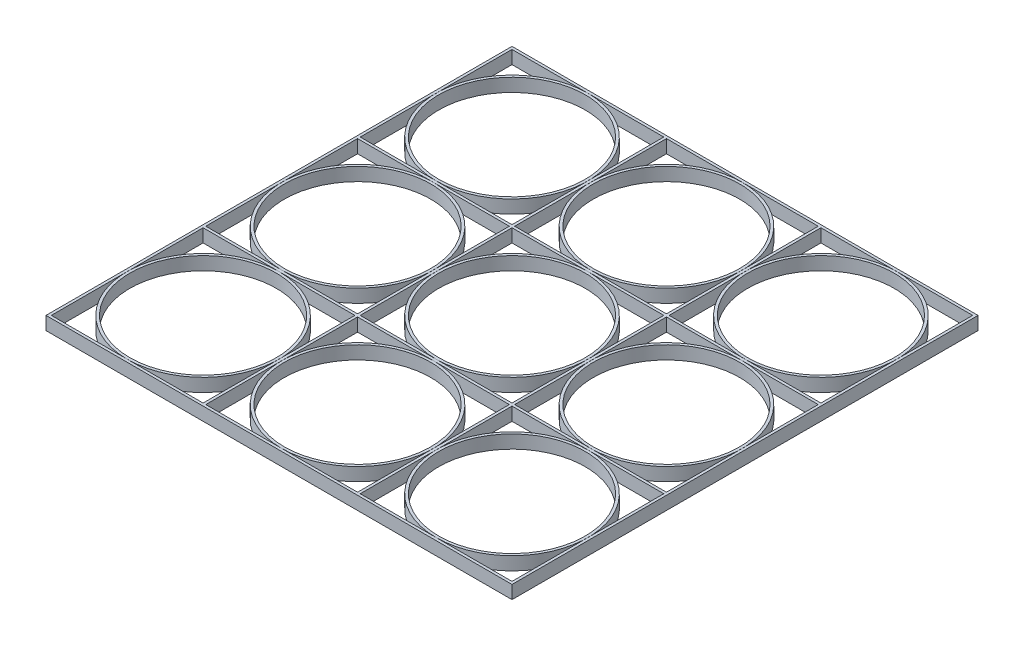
ISO-10303-21;
HEADER;
FILE_DESCRIPTION(('STEP AP214'),'2;1');
FILE_NAME('part.step','',(''),(''),'','','');
FILE_SCHEMA(('AUTOMOTIVE_DESIGN { 1 0 10303 214 1 1 1 1 }'));
ENDSEC;
DATA;
#1=APPLICATION_CONTEXT('core data for automotive mechanical design processes');
#2=APPLICATION_PROTOCOL_DEFINITION('international standard','automotive_design',2000,#1);
#3=PRODUCT_CONTEXT('',#1,'mechanical');
#4=PRODUCT('Part','Part','',(#3));
#5=PRODUCT_RELATED_PRODUCT_CATEGORY('part','',(#4));
#6=PRODUCT_DEFINITION_FORMATION('','',#4);
#7=PRODUCT_DEFINITION_CONTEXT('part definition',#1,'design');
#8=PRODUCT_DEFINITION('design','',#6,#7);
#9=PRODUCT_DEFINITION_SHAPE('','',#8);
#10=(LENGTH_UNIT() NAMED_UNIT(*) SI_UNIT(.MILLI.,.METRE.));
#11=(NAMED_UNIT(*) PLANE_ANGLE_UNIT() SI_UNIT($,.RADIAN.));
#12=(NAMED_UNIT(*) SI_UNIT($,.STERADIAN.) SOLID_ANGLE_UNIT());
#13=UNCERTAINTY_MEASURE_WITH_UNIT(LENGTH_MEASURE(1.E-05),#10,'distance_accuracy_value','');
#14=(GEOMETRIC_REPRESENTATION_CONTEXT(3) GLOBAL_UNCERTAINTY_ASSIGNED_CONTEXT((#13)) GLOBAL_UNIT_ASSIGNED_CONTEXT((#10,
#11,#12)) REPRESENTATION_CONTEXT('',''));
#15=CARTESIAN_POINT('',(0.,0.,0.));
#16=DIRECTION('',(0.,0.,1.));
#17=DIRECTION('',(1.,0.,0.));
#18=AXIS2_PLACEMENT_3D('',#15,#16,#17);
#19=CARTESIAN_POINT('',(0.,5.,117.));
#20=DIRECTION('',(0.,1.,0.));
#21=DIRECTION('',(0.,0.,1.));
#22=AXIS2_PLACEMENT_3D('',#19,#20,#21);
#23=PLANE('',#22);
#24=CARTESIAN_POINT('',(0.,5.,117.));
#25=DIRECTION('',(0.,1.,0.));
#26=DIRECTION('',(0.,0.,1.));
#27=AXIS2_PLACEMENT_3D('',#24,#25,#26);
#28=CIRCLE('',#27,28.75);
#29=CARTESIAN_POINT('',(0.,5.,145.75));
#30=VERTEX_POINT('',#29);
#31=EDGE_CURVE('E12',#30,#30,#28,.T.);
#32=ORIENTED_EDGE('',*,*,#31,.T.);
#33=EDGE_LOOP('',(#32));
#34=FACE_BOUND('',#33,.T.);
#35=CARTESIAN_POINT('',(0.,5.,117.));
#36=DIRECTION('',(0.,1.,0.));
#37=DIRECTION('',(0.,0.,1.));
#38=AXIS2_PLACEMENT_3D('',#35,#36,#37);
#39=CIRCLE('',#38,27.75);
#40=CARTESIAN_POINT('',(0.,5.,144.75));
#41=VERTEX_POINT('',#40);
#42=EDGE_CURVE('E79',#41,#41,#39,.T.);
#43=ORIENTED_EDGE('',*,*,#42,.F.);
#44=EDGE_LOOP('',(#43));
#45=FACE_BOUND('',#44,.T.);
#46=ADVANCED_FACE('F68',(#34,#45),#23,.T.);
#47=CARTESIAN_POINT('',(0.,0.,117.));
#48=DIRECTION('',(0.,1.,0.));
#49=DIRECTION('',(0.,0.,1.));
#50=AXIS2_PLACEMENT_3D('',#47,#48,#49);
#51=PLANE('',#50);
#52=CARTESIAN_POINT('',(0.,0.,117.));
#53=DIRECTION('',(0.,1.,0.));
#54=DIRECTION('',(0.,0.,1.));
#55=AXIS2_PLACEMENT_3D('',#52,#53,#54);
#56=CIRCLE('',#55,28.75);
#57=CARTESIAN_POINT('',(0.,0.,145.75));
#58=VERTEX_POINT('',#57);
#59=EDGE_CURVE('E72',#58,#58,#56,.T.);
#60=ORIENTED_EDGE('',*,*,#59,.F.);
#61=EDGE_LOOP('',(#60));
#62=FACE_BOUND('',#61,.T.);
#63=CARTESIAN_POINT('',(0.,0.,117.));
#64=DIRECTION('',(0.,1.,0.));
#65=DIRECTION('',(0.,0.,1.));
#66=AXIS2_PLACEMENT_3D('',#63,#64,#65);
#67=CIRCLE('',#66,27.75);
#68=CARTESIAN_POINT('',(0.,0.,144.75));
#69=VERTEX_POINT('',#68);
#70=EDGE_CURVE('E81',#69,#69,#67,.T.);
#71=ORIENTED_EDGE('',*,*,#70,.T.);
#72=EDGE_LOOP('',(#71));
#73=FACE_BOUND('',#72,.T.);
#74=ADVANCED_FACE('F91',(#62,#73),#51,.F.);
#75=CARTESIAN_POINT('',(0.,5.,117.));
#76=DIRECTION('',(0.,-1.,0.));
#77=DIRECTION('',(0.,0.,-1.));
#78=AXIS2_PLACEMENT_3D('',#75,#76,#77);
#79=CYLINDRICAL_SURFACE('',#78,28.75);
#80=ORIENTED_EDGE('',*,*,#31,.F.);
#81=EDGE_LOOP('',(#80));
#82=FACE_BOUND('',#81,.T.);
#83=ORIENTED_EDGE('',*,*,#59,.T.);
#84=EDGE_LOOP('',(#83));
#85=FACE_BOUND('',#84,.T.);
#86=ADVANCED_FACE('F70',(#82,#85),#79,.T.);
#87=CARTESIAN_POINT('',(0.,5.,117.));
#88=DIRECTION('',(0.,-1.,0.));
#89=DIRECTION('',(0.,0.,-1.));
#90=AXIS2_PLACEMENT_3D('',#87,#88,#89);
#91=CYLINDRICAL_SURFACE('',#90,27.75);
#92=ORIENTED_EDGE('',*,*,#42,.T.);
#93=EDGE_LOOP('',(#92));
#94=FACE_BOUND('',#93,.T.);
#95=ORIENTED_EDGE('',*,*,#70,.F.);
#96=EDGE_LOOP('',(#95));
#97=FACE_BOUND('',#96,.T.);
#98=ADVANCED_FACE('F87',(#94,#97),#91,.F.);
#99=CLOSED_SHELL('',(#46,#74,#86,#98));
#100=MANIFOLD_SOLID_BREP('B2',#99);
#101=CARTESIAN_POINT('',(0.,5.,58.5));
#102=DIRECTION('',(0.,1.,0.));
#103=DIRECTION('',(0.,0.,1.));
#104=AXIS2_PLACEMENT_3D('',#101,#102,#103);
#105=PLANE('',#104);
#106=CARTESIAN_POINT('',(0.,5.,58.5));
#107=DIRECTION('',(0.,1.,0.));
#108=DIRECTION('',(0.,0.,1.));
#109=AXIS2_PLACEMENT_3D('',#106,#107,#108);
#110=CIRCLE('',#109,28.75);
#111=CARTESIAN_POINT('',(0.,5.,87.25));
#112=VERTEX_POINT('',#111);
#113=EDGE_CURVE('E67',#112,#112,#110,.T.);
#114=ORIENTED_EDGE('',*,*,#113,.T.);
#115=EDGE_LOOP('',(#114));
#116=FACE_BOUND('',#115,.T.);
#117=CARTESIAN_POINT('',(0.,5.,58.5));
#118=DIRECTION('',(0.,1.,0.));
#119=DIRECTION('',(0.,0.,1.));
#120=AXIS2_PLACEMENT_3D('',#117,#118,#119);
#121=CIRCLE('',#120,27.75);
#122=CARTESIAN_POINT('',(0.,5.,86.25));
#123=VERTEX_POINT('',#122);
#124=EDGE_CURVE('E149',#123,#123,#121,.T.);
#125=ORIENTED_EDGE('',*,*,#124,.F.);
#126=EDGE_LOOP('',(#125));
#127=FACE_BOUND('',#126,.T.);
#128=ADVANCED_FACE('F138',(#116,#127),#105,.T.);
#129=CARTESIAN_POINT('',(0.,0.,58.5));
#130=DIRECTION('',(0.,1.,0.));
#131=DIRECTION('',(0.,0.,1.));
#132=AXIS2_PLACEMENT_3D('',#129,#130,#131);
#133=PLANE('',#132);
#134=CARTESIAN_POINT('',(0.,0.,58.5));
#135=DIRECTION('',(0.,1.,0.));
#136=DIRECTION('',(0.,0.,1.));
#137=AXIS2_PLACEMENT_3D('',#134,#135,#136);
#138=CIRCLE('',#137,28.75);
#139=CARTESIAN_POINT('',(0.,0.,87.25));
#140=VERTEX_POINT('',#139);
#141=EDGE_CURVE('E142',#140,#140,#138,.T.);
#142=ORIENTED_EDGE('',*,*,#141,.F.);
#143=EDGE_LOOP('',(#142));
#144=FACE_BOUND('',#143,.T.);
#145=CARTESIAN_POINT('',(0.,0.,58.5));
#146=DIRECTION('',(0.,1.,0.));
#147=DIRECTION('',(0.,0.,1.));
#148=AXIS2_PLACEMENT_3D('',#145,#146,#147);
#149=CIRCLE('',#148,27.75);
#150=CARTESIAN_POINT('',(0.,0.,86.25));
#151=VERTEX_POINT('',#150);
#152=EDGE_CURVE('E151',#151,#151,#149,.T.);
#153=ORIENTED_EDGE('',*,*,#152,.T.);
#154=EDGE_LOOP('',(#153));
#155=FACE_BOUND('',#154,.T.);
#156=ADVANCED_FACE('F161',(#144,#155),#133,.F.);
#157=CARTESIAN_POINT('',(0.,5.,58.5));
#158=DIRECTION('',(0.,-1.,0.));
#159=DIRECTION('',(0.,0.,-1.));
#160=AXIS2_PLACEMENT_3D('',#157,#158,#159);
#161=CYLINDRICAL_SURFACE('',#160,28.75);
#162=ORIENTED_EDGE('',*,*,#113,.F.);
#163=EDGE_LOOP('',(#162));
#164=FACE_BOUND('',#163,.T.);
#165=ORIENTED_EDGE('',*,*,#141,.T.);
#166=EDGE_LOOP('',(#165));
#167=FACE_BOUND('',#166,.T.);
#168=ADVANCED_FACE('F140',(#164,#167),#161,.T.);
#169=CARTESIAN_POINT('',(0.,5.,58.5));
#170=DIRECTION('',(0.,-1.,0.));
#171=DIRECTION('',(0.,0.,-1.));
#172=AXIS2_PLACEMENT_3D('',#169,#170,#171);
#173=CYLINDRICAL_SURFACE('',#172,27.75);
#174=ORIENTED_EDGE('',*,*,#124,.T.);
#175=EDGE_LOOP('',(#174));
#176=FACE_BOUND('',#175,.T.);
#177=ORIENTED_EDGE('',*,*,#152,.F.);
#178=EDGE_LOOP('',(#177));
#179=FACE_BOUND('',#178,.T.);
#180=ADVANCED_FACE('F157',(#176,#179),#173,.F.);
#181=CLOSED_SHELL('',(#128,#156,#168,#180));
#182=MANIFOLD_SOLID_BREP('B7',#181);
#183=CARTESIAN_POINT('',(117.,5.,117.));
#184=DIRECTION('',(0.,1.,0.));
#185=DIRECTION('',(0.,0.,1.));
#186=AXIS2_PLACEMENT_3D('',#183,#184,#185);
#187=PLANE('',#186);
#188=CARTESIAN_POINT('',(117.,5.,117.));
#189=DIRECTION('',(0.,1.,0.));
#190=DIRECTION('',(0.,0.,1.));
#191=AXIS2_PLACEMENT_3D('',#188,#189,#190);
#192=CIRCLE('',#191,28.75);
#193=CARTESIAN_POINT('',(117.,5.,145.75));
#194=VERTEX_POINT('',#193);
#195=EDGE_CURVE('E137',#194,#194,#192,.T.);
#196=ORIENTED_EDGE('',*,*,#195,.T.);
#197=EDGE_LOOP('',(#196));
#198=FACE_BOUND('',#197,.T.);
#199=CARTESIAN_POINT('',(117.,5.,117.));
#200=DIRECTION('',(0.,1.,0.));
#201=DIRECTION('',(0.,0.,1.));
#202=AXIS2_PLACEMENT_3D('',#199,#200,#201);
#203=CIRCLE('',#202,27.75);
#204=CARTESIAN_POINT('',(117.,5.,144.75));
#205=VERTEX_POINT('',#204);
#206=EDGE_CURVE('E219',#205,#205,#203,.T.);
#207=ORIENTED_EDGE('',*,*,#206,.F.);
#208=EDGE_LOOP('',(#207));
#209=FACE_BOUND('',#208,.T.);
#210=ADVANCED_FACE('F208',(#198,#209),#187,.T.);
#211=CARTESIAN_POINT('',(117.,0.,117.));
#212=DIRECTION('',(0.,1.,0.));
#213=DIRECTION('',(0.,0.,1.));
#214=AXIS2_PLACEMENT_3D('',#211,#212,#213);
#215=PLANE('',#214);
#216=CARTESIAN_POINT('',(117.,0.,117.));
#217=DIRECTION('',(0.,1.,0.));
#218=DIRECTION('',(0.,0.,1.));
#219=AXIS2_PLACEMENT_3D('',#216,#217,#218);
#220=CIRCLE('',#219,28.75);
#221=CARTESIAN_POINT('',(117.,0.,145.75));
#222=VERTEX_POINT('',#221);
#223=EDGE_CURVE('E212',#222,#222,#220,.T.);
#224=ORIENTED_EDGE('',*,*,#223,.F.);
#225=EDGE_LOOP('',(#224));
#226=FACE_BOUND('',#225,.T.);
#227=CARTESIAN_POINT('',(117.,0.,117.));
#228=DIRECTION('',(0.,1.,0.));
#229=DIRECTION('',(0.,0.,1.));
#230=AXIS2_PLACEMENT_3D('',#227,#228,#229);
#231=CIRCLE('',#230,27.75);
#232=CARTESIAN_POINT('',(117.,0.,144.75));
#233=VERTEX_POINT('',#232);
#234=EDGE_CURVE('E221',#233,#233,#231,.T.);
#235=ORIENTED_EDGE('',*,*,#234,.T.);
#236=EDGE_LOOP('',(#235));
#237=FACE_BOUND('',#236,.T.);
#238=ADVANCED_FACE('F231',(#226,#237),#215,.F.);
#239=CARTESIAN_POINT('',(117.,5.,117.));
#240=DIRECTION('',(0.,-1.,0.));
#241=DIRECTION('',(0.,0.,-1.));
#242=AXIS2_PLACEMENT_3D('',#239,#240,#241);
#243=CYLINDRICAL_SURFACE('',#242,28.75);
#244=ORIENTED_EDGE('',*,*,#195,.F.);
#245=EDGE_LOOP('',(#244));
#246=FACE_BOUND('',#245,.T.);
#247=ORIENTED_EDGE('',*,*,#223,.T.);
#248=EDGE_LOOP('',(#247));
#249=FACE_BOUND('',#248,.T.);
#250=ADVANCED_FACE('F210',(#246,#249),#243,.T.);
#251=CARTESIAN_POINT('',(117.,5.,117.));
#252=DIRECTION('',(0.,-1.,0.));
#253=DIRECTION('',(0.,0.,-1.));
#254=AXIS2_PLACEMENT_3D('',#251,#252,#253);
#255=CYLINDRICAL_SURFACE('',#254,27.75);
#256=ORIENTED_EDGE('',*,*,#206,.T.);
#257=EDGE_LOOP('',(#256));
#258=FACE_BOUND('',#257,.T.);
#259=ORIENTED_EDGE('',*,*,#234,.F.);
#260=EDGE_LOOP('',(#259));
#261=FACE_BOUND('',#260,.T.);
#262=ADVANCED_FACE('F227',(#258,#261),#255,.F.);
#263=CLOSED_SHELL('',(#210,#238,#250,#262));
#264=MANIFOLD_SOLID_BREP('B62',#263);
#265=CARTESIAN_POINT('',(117.,5.,58.5));
#266=DIRECTION('',(0.,1.,0.));
#267=DIRECTION('',(0.,0.,1.));
#268=AXIS2_PLACEMENT_3D('',#265,#266,#267);
#269=PLANE('',#268);
#270=CARTESIAN_POINT('',(117.,5.,58.5));
#271=DIRECTION('',(0.,1.,0.));
#272=DIRECTION('',(0.,0.,1.));
#273=AXIS2_PLACEMENT_3D('',#270,#271,#272);
#274=CIRCLE('',#273,28.75);
#275=CARTESIAN_POINT('',(117.,5.,87.25));
#276=VERTEX_POINT('',#275);
#277=EDGE_CURVE('E207',#276,#276,#274,.T.);
#278=ORIENTED_EDGE('',*,*,#277,.T.);
#279=EDGE_LOOP('',(#278));
#280=FACE_BOUND('',#279,.T.);
#281=CARTESIAN_POINT('',(117.,5.,58.5));
#282=DIRECTION('',(0.,1.,0.));
#283=DIRECTION('',(0.,0.,1.));
#284=AXIS2_PLACEMENT_3D('',#281,#282,#283);
#285=CIRCLE('',#284,27.75);
#286=CARTESIAN_POINT('',(117.,5.,86.25));
#287=VERTEX_POINT('',#286);
#288=EDGE_CURVE('E289',#287,#287,#285,.T.);
#289=ORIENTED_EDGE('',*,*,#288,.F.);
#290=EDGE_LOOP('',(#289));
#291=FACE_BOUND('',#290,.T.);
#292=ADVANCED_FACE('F278',(#280,#291),#269,.T.);
#293=CARTESIAN_POINT('',(117.,0.,58.5));
#294=DIRECTION('',(0.,1.,0.));
#295=DIRECTION('',(0.,0.,1.));
#296=AXIS2_PLACEMENT_3D('',#293,#294,#295);
#297=PLANE('',#296);
#298=CARTESIAN_POINT('',(117.,0.,58.5));
#299=DIRECTION('',(0.,1.,0.));
#300=DIRECTION('',(0.,0.,1.));
#301=AXIS2_PLACEMENT_3D('',#298,#299,#300);
#302=CIRCLE('',#301,28.75);
#303=CARTESIAN_POINT('',(117.,0.,87.25));
#304=VERTEX_POINT('',#303);
#305=EDGE_CURVE('E282',#304,#304,#302,.T.);
#306=ORIENTED_EDGE('',*,*,#305,.F.);
#307=EDGE_LOOP('',(#306));
#308=FACE_BOUND('',#307,.T.);
#309=CARTESIAN_POINT('',(117.,0.,58.5));
#310=DIRECTION('',(0.,1.,0.));
#311=DIRECTION('',(0.,0.,1.));
#312=AXIS2_PLACEMENT_3D('',#309,#310,#311);
#313=CIRCLE('',#312,27.75);
#314=CARTESIAN_POINT('',(117.,0.,86.25));
#315=VERTEX_POINT('',#314);
#316=EDGE_CURVE('E291',#315,#315,#313,.T.);
#317=ORIENTED_EDGE('',*,*,#316,.T.);
#318=EDGE_LOOP('',(#317));
#319=FACE_BOUND('',#318,.T.);
#320=ADVANCED_FACE('F301',(#308,#319),#297,.F.);
#321=CARTESIAN_POINT('',(117.,5.,58.5));
#322=DIRECTION('',(0.,-1.,0.));
#323=DIRECTION('',(0.,0.,-1.));
#324=AXIS2_PLACEMENT_3D('',#321,#322,#323);
#325=CYLINDRICAL_SURFACE('',#324,28.75);
#326=ORIENTED_EDGE('',*,*,#277,.F.);
#327=EDGE_LOOP('',(#326));
#328=FACE_BOUND('',#327,.T.);
#329=ORIENTED_EDGE('',*,*,#305,.T.);
#330=EDGE_LOOP('',(#329));
#331=FACE_BOUND('',#330,.T.);
#332=ADVANCED_FACE('F280',(#328,#331),#325,.T.);
#333=CARTESIAN_POINT('',(117.,5.,58.5));
#334=DIRECTION('',(0.,-1.,0.));
#335=DIRECTION('',(0.,0.,-1.));
#336=AXIS2_PLACEMENT_3D('',#333,#334,#335);
#337=CYLINDRICAL_SURFACE('',#336,27.75);
#338=ORIENTED_EDGE('',*,*,#288,.T.);
#339=EDGE_LOOP('',(#338));
#340=FACE_BOUND('',#339,.T.);
#341=ORIENTED_EDGE('',*,*,#316,.F.);
#342=EDGE_LOOP('',(#341));
#343=FACE_BOUND('',#342,.T.);
#344=ADVANCED_FACE('F297',(#340,#343),#337,.F.);
#345=CLOSED_SHELL('',(#292,#320,#332,#344));
#346=MANIFOLD_SOLID_BREP('B132',#345);
#347=CARTESIAN_POINT('',(58.5,5.,117.));
#348=DIRECTION('',(0.,1.,0.));
#349=DIRECTION('',(0.,0.,1.));
#350=AXIS2_PLACEMENT_3D('',#347,#348,#349);
#351=PLANE('',#350);
#352=CARTESIAN_POINT('',(58.5,5.,117.));
#353=DIRECTION('',(0.,1.,0.));
#354=DIRECTION('',(0.,0.,1.));
#355=AXIS2_PLACEMENT_3D('',#352,#353,#354);
#356=CIRCLE('',#355,28.75);
#357=CARTESIAN_POINT('',(58.5,5.,145.75));
#358=VERTEX_POINT('',#357);
#359=EDGE_CURVE('E277',#358,#358,#356,.T.);
#360=ORIENTED_EDGE('',*,*,#359,.T.);
#361=EDGE_LOOP('',(#360));
#362=FACE_BOUND('',#361,.T.);
#363=CARTESIAN_POINT('',(58.5,5.,117.));
#364=DIRECTION('',(0.,1.,0.));
#365=DIRECTION('',(0.,0.,1.));
#366=AXIS2_PLACEMENT_3D('',#363,#364,#365);
#367=CIRCLE('',#366,27.75);
#368=CARTESIAN_POINT('',(58.5,5.,144.75));
#369=VERTEX_POINT('',#368);
#370=EDGE_CURVE('E359',#369,#369,#367,.T.);
#371=ORIENTED_EDGE('',*,*,#370,.F.);
#372=EDGE_LOOP('',(#371));
#373=FACE_BOUND('',#372,.T.);
#374=ADVANCED_FACE('F348',(#362,#373),#351,.T.);
#375=CARTESIAN_POINT('',(58.5,0.,117.));
#376=DIRECTION('',(0.,1.,0.));
#377=DIRECTION('',(0.,0.,1.));
#378=AXIS2_PLACEMENT_3D('',#375,#376,#377);
#379=PLANE('',#378);
#380=CARTESIAN_POINT('',(58.5,0.,117.));
#381=DIRECTION('',(0.,1.,0.));
#382=DIRECTION('',(0.,0.,1.));
#383=AXIS2_PLACEMENT_3D('',#380,#381,#382);
#384=CIRCLE('',#383,28.75);
#385=CARTESIAN_POINT('',(58.5,0.,145.75));
#386=VERTEX_POINT('',#385);
#387=EDGE_CURVE('E352',#386,#386,#384,.T.);
#388=ORIENTED_EDGE('',*,*,#387,.F.);
#389=EDGE_LOOP('',(#388));
#390=FACE_BOUND('',#389,.T.);
#391=CARTESIAN_POINT('',(58.5,0.,117.));
#392=DIRECTION('',(0.,1.,0.));
#393=DIRECTION('',(0.,0.,1.));
#394=AXIS2_PLACEMENT_3D('',#391,#392,#393);
#395=CIRCLE('',#394,27.75);
#396=CARTESIAN_POINT('',(58.5,0.,144.75));
#397=VERTEX_POINT('',#396);
#398=EDGE_CURVE('E361',#397,#397,#395,.T.);
#399=ORIENTED_EDGE('',*,*,#398,.T.);
#400=EDGE_LOOP('',(#399));
#401=FACE_BOUND('',#400,.T.);
#402=ADVANCED_FACE('F371',(#390,#401),#379,.F.);
#403=CARTESIAN_POINT('',(58.5,5.,117.));
#404=DIRECTION('',(0.,-1.,0.));
#405=DIRECTION('',(0.,0.,-1.));
#406=AXIS2_PLACEMENT_3D('',#403,#404,#405);
#407=CYLINDRICAL_SURFACE('',#406,28.75);
#408=ORIENTED_EDGE('',*,*,#359,.F.);
#409=EDGE_LOOP('',(#408));
#410=FACE_BOUND('',#409,.T.);
#411=ORIENTED_EDGE('',*,*,#387,.T.);
#412=EDGE_LOOP('',(#411));
#413=FACE_BOUND('',#412,.T.);
#414=ADVANCED_FACE('F350',(#410,#413),#407,.T.);
#415=CARTESIAN_POINT('',(58.5,5.,117.));
#416=DIRECTION('',(0.,-1.,0.));
#417=DIRECTION('',(0.,0.,-1.));
#418=AXIS2_PLACEMENT_3D('',#415,#416,#417);
#419=CYLINDRICAL_SURFACE('',#418,27.75);
#420=ORIENTED_EDGE('',*,*,#370,.T.);
#421=EDGE_LOOP('',(#420));
#422=FACE_BOUND('',#421,.T.);
#423=ORIENTED_EDGE('',*,*,#398,.F.);
#424=EDGE_LOOP('',(#423));
#425=FACE_BOUND('',#424,.T.);
#426=ADVANCED_FACE('F367',(#422,#425),#419,.F.);
#427=CLOSED_SHELL('',(#374,#402,#414,#426));
#428=MANIFOLD_SOLID_BREP('B202',#427);
#429=CARTESIAN_POINT('',(58.5,5.,58.5));
#430=DIRECTION('',(0.,1.,0.));
#431=DIRECTION('',(0.,0.,1.));
#432=AXIS2_PLACEMENT_3D('',#429,#430,#431);
#433=PLANE('',#432);
#434=CARTESIAN_POINT('',(58.5,5.,58.5));
#435=DIRECTION('',(0.,1.,0.));
#436=DIRECTION('',(0.,0.,1.));
#437=AXIS2_PLACEMENT_3D('',#434,#435,#436);
#438=CIRCLE('',#437,28.75);
#439=CARTESIAN_POINT('',(58.5,5.,87.25));
#440=VERTEX_POINT('',#439);
#441=EDGE_CURVE('E347',#440,#440,#438,.T.);
#442=ORIENTED_EDGE('',*,*,#441,.T.);
#443=EDGE_LOOP('',(#442));
#444=FACE_BOUND('',#443,.T.);
#445=CARTESIAN_POINT('',(58.5,5.,58.5));
#446=DIRECTION('',(0.,1.,0.));
#447=DIRECTION('',(0.,0.,1.));
#448=AXIS2_PLACEMENT_3D('',#445,#446,#447);
#449=CIRCLE('',#448,27.75);
#450=CARTESIAN_POINT('',(58.5,5.,86.25));
#451=VERTEX_POINT('',#450);
#452=EDGE_CURVE('E429',#451,#451,#449,.T.);
#453=ORIENTED_EDGE('',*,*,#452,.F.);
#454=EDGE_LOOP('',(#453));
#455=FACE_BOUND('',#454,.T.);
#456=ADVANCED_FACE('F418',(#444,#455),#433,.T.);
#457=CARTESIAN_POINT('',(58.5,0.,58.5));
#458=DIRECTION('',(0.,1.,0.));
#459=DIRECTION('',(0.,0.,1.));
#460=AXIS2_PLACEMENT_3D('',#457,#458,#459);
#461=PLANE('',#460);
#462=CARTESIAN_POINT('',(58.5,0.,58.5));
#463=DIRECTION('',(0.,1.,0.));
#464=DIRECTION('',(0.,0.,1.));
#465=AXIS2_PLACEMENT_3D('',#462,#463,#464);
#466=CIRCLE('',#465,28.75);
#467=CARTESIAN_POINT('',(58.5,0.,87.25));
#468=VERTEX_POINT('',#467);
#469=EDGE_CURVE('E422',#468,#468,#466,.T.);
#470=ORIENTED_EDGE('',*,*,#469,.F.);
#471=EDGE_LOOP('',(#470));
#472=FACE_BOUND('',#471,.T.);
#473=CARTESIAN_POINT('',(58.5,0.,58.5));
#474=DIRECTION('',(0.,1.,0.));
#475=DIRECTION('',(0.,0.,1.));
#476=AXIS2_PLACEMENT_3D('',#473,#474,#475);
#477=CIRCLE('',#476,27.75);
#478=CARTESIAN_POINT('',(58.5,0.,86.25));
#479=VERTEX_POINT('',#478);
#480=EDGE_CURVE('E431',#479,#479,#477,.T.);
#481=ORIENTED_EDGE('',*,*,#480,.T.);
#482=EDGE_LOOP('',(#481));
#483=FACE_BOUND('',#482,.T.);
#484=ADVANCED_FACE('F441',(#472,#483),#461,.F.);
#485=CARTESIAN_POINT('',(58.5,5.,58.5));
#486=DIRECTION('',(0.,-1.,0.));
#487=DIRECTION('',(0.,0.,-1.));
#488=AXIS2_PLACEMENT_3D('',#485,#486,#487);
#489=CYLINDRICAL_SURFACE('',#488,28.75);
#490=ORIENTED_EDGE('',*,*,#441,.F.);
#491=EDGE_LOOP('',(#490));
#492=FACE_BOUND('',#491,.T.);
#493=ORIENTED_EDGE('',*,*,#469,.T.);
#494=EDGE_LOOP('',(#493));
#495=FACE_BOUND('',#494,.T.);
#496=ADVANCED_FACE('F420',(#492,#495),#489,.T.);
#497=CARTESIAN_POINT('',(58.5,5.,58.5));
#498=DIRECTION('',(0.,-1.,0.));
#499=DIRECTION('',(0.,0.,-1.));
#500=AXIS2_PLACEMENT_3D('',#497,#498,#499);
#501=CYLINDRICAL_SURFACE('',#500,27.75);
#502=ORIENTED_EDGE('',*,*,#452,.T.);
#503=EDGE_LOOP('',(#502));
#504=FACE_BOUND('',#503,.T.);
#505=ORIENTED_EDGE('',*,*,#480,.F.);
#506=EDGE_LOOP('',(#505));
#507=FACE_BOUND('',#506,.T.);
#508=ADVANCED_FACE('F437',(#504,#507),#501,.F.);
#509=CLOSED_SHELL('',(#456,#484,#496,#508));
#510=MANIFOLD_SOLID_BREP('B272',#509);
#511=CARTESIAN_POINT('',(117.,5.,0.));
#512=DIRECTION('',(0.,1.,0.));
#513=DIRECTION('',(0.,0.,1.));
#514=AXIS2_PLACEMENT_3D('',#511,#512,#513);
#515=PLANE('',#514);
#516=CARTESIAN_POINT('',(117.,5.,0.));
#517=DIRECTION('',(0.,1.,0.));
#518=DIRECTION('',(0.,0.,1.));
#519=AXIS2_PLACEMENT_3D('',#516,#517,#518);
#520=CIRCLE('',#519,28.75);
#521=CARTESIAN_POINT('',(117.,5.,28.75));
#522=VERTEX_POINT('',#521);
#523=EDGE_CURVE('E417',#522,#522,#520,.T.);
#524=ORIENTED_EDGE('',*,*,#523,.T.);
#525=EDGE_LOOP('',(#524));
#526=FACE_BOUND('',#525,.T.);
#527=CARTESIAN_POINT('',(117.,5.,0.));
#528=DIRECTION('',(0.,1.,0.));
#529=DIRECTION('',(0.,0.,1.));
#530=AXIS2_PLACEMENT_3D('',#527,#528,#529);
#531=CIRCLE('',#530,27.75);
#532=CARTESIAN_POINT('',(117.,5.,27.75));
#533=VERTEX_POINT('',#532);
#534=EDGE_CURVE('E499',#533,#533,#531,.T.);
#535=ORIENTED_EDGE('',*,*,#534,.F.);
#536=EDGE_LOOP('',(#535));
#537=FACE_BOUND('',#536,.T.);
#538=ADVANCED_FACE('F488',(#526,#537),#515,.T.);
#539=CARTESIAN_POINT('',(117.,0.,0.));
#540=DIRECTION('',(0.,1.,0.));
#541=DIRECTION('',(0.,0.,1.));
#542=AXIS2_PLACEMENT_3D('',#539,#540,#541);
#543=PLANE('',#542);
#544=CARTESIAN_POINT('',(117.,0.,0.));
#545=DIRECTION('',(0.,1.,0.));
#546=DIRECTION('',(0.,0.,1.));
#547=AXIS2_PLACEMENT_3D('',#544,#545,#546);
#548=CIRCLE('',#547,28.75);
#549=CARTESIAN_POINT('',(117.,0.,28.75));
#550=VERTEX_POINT('',#549);
#551=EDGE_CURVE('E492',#550,#550,#548,.T.);
#552=ORIENTED_EDGE('',*,*,#551,.F.);
#553=EDGE_LOOP('',(#552));
#554=FACE_BOUND('',#553,.T.);
#555=CARTESIAN_POINT('',(117.,0.,0.));
#556=DIRECTION('',(0.,1.,0.));
#557=DIRECTION('',(0.,0.,1.));
#558=AXIS2_PLACEMENT_3D('',#555,#556,#557);
#559=CIRCLE('',#558,27.75);
#560=CARTESIAN_POINT('',(117.,0.,27.75));
#561=VERTEX_POINT('',#560);
#562=EDGE_CURVE('E501',#561,#561,#559,.T.);
#563=ORIENTED_EDGE('',*,*,#562,.T.);
#564=EDGE_LOOP('',(#563));
#565=FACE_BOUND('',#564,.T.);
#566=ADVANCED_FACE('F511',(#554,#565),#543,.F.);
#567=CARTESIAN_POINT('',(117.,5.,0.));
#568=DIRECTION('',(0.,-1.,0.));
#569=DIRECTION('',(0.,0.,-1.));
#570=AXIS2_PLACEMENT_3D('',#567,#568,#569);
#571=CYLINDRICAL_SURFACE('',#570,28.75);
#572=ORIENTED_EDGE('',*,*,#523,.F.);
#573=EDGE_LOOP('',(#572));
#574=FACE_BOUND('',#573,.T.);
#575=ORIENTED_EDGE('',*,*,#551,.T.);
#576=EDGE_LOOP('',(#575));
#577=FACE_BOUND('',#576,.T.);
#578=ADVANCED_FACE('F490',(#574,#577),#571,.T.);
#579=CARTESIAN_POINT('',(117.,5.,0.));
#580=DIRECTION('',(0.,-1.,0.));
#581=DIRECTION('',(0.,0.,-1.));
#582=AXIS2_PLACEMENT_3D('',#579,#580,#581);
#583=CYLINDRICAL_SURFACE('',#582,27.75);
#584=ORIENTED_EDGE('',*,*,#534,.T.);
#585=EDGE_LOOP('',(#584));
#586=FACE_BOUND('',#585,.T.);
#587=ORIENTED_EDGE('',*,*,#562,.F.);
#588=EDGE_LOOP('',(#587));
#589=FACE_BOUND('',#588,.T.);
#590=ADVANCED_FACE('F507',(#586,#589),#583,.F.);
#591=CLOSED_SHELL('',(#538,#566,#578,#590));
#592=MANIFOLD_SOLID_BREP('B342',#591);
#593=CARTESIAN_POINT('',(58.5,5.,0.));
#594=DIRECTION('',(0.,1.,0.));
#595=DIRECTION('',(0.,0.,1.));
#596=AXIS2_PLACEMENT_3D('',#593,#594,#595);
#597=PLANE('',#596);
#598=CARTESIAN_POINT('',(58.5,5.,0.));
#599=DIRECTION('',(0.,1.,0.));
#600=DIRECTION('',(0.,0.,1.));
#601=AXIS2_PLACEMENT_3D('',#598,#599,#600);
#602=CIRCLE('',#601,28.75);
#603=CARTESIAN_POINT('',(58.5,5.,28.75));
#604=VERTEX_POINT('',#603);
#605=EDGE_CURVE('E487',#604,#604,#602,.T.);
#606=ORIENTED_EDGE('',*,*,#605,.T.);
#607=EDGE_LOOP('',(#606));
#608=FACE_BOUND('',#607,.T.);
#609=CARTESIAN_POINT('',(58.5,5.,0.));
#610=DIRECTION('',(0.,1.,0.));
#611=DIRECTION('',(0.,0.,1.));
#612=AXIS2_PLACEMENT_3D('',#609,#610,#611);
#613=CIRCLE('',#612,27.75);
#614=CARTESIAN_POINT('',(58.5,5.,27.75));
#615=VERTEX_POINT('',#614);
#616=EDGE_CURVE('E569',#615,#615,#613,.T.);
#617=ORIENTED_EDGE('',*,*,#616,.F.);
#618=EDGE_LOOP('',(#617));
#619=FACE_BOUND('',#618,.T.);
#620=ADVANCED_FACE('F558',(#608,#619),#597,.T.);
#621=CARTESIAN_POINT('',(58.5,0.,0.));
#622=DIRECTION('',(0.,1.,0.));
#623=DIRECTION('',(0.,0.,1.));
#624=AXIS2_PLACEMENT_3D('',#621,#622,#623);
#625=PLANE('',#624);
#626=CARTESIAN_POINT('',(58.5,0.,0.));
#627=DIRECTION('',(0.,1.,0.));
#628=DIRECTION('',(0.,0.,1.));
#629=AXIS2_PLACEMENT_3D('',#626,#627,#628);
#630=CIRCLE('',#629,28.75);
#631=CARTESIAN_POINT('',(58.5,0.,28.75));
#632=VERTEX_POINT('',#631);
#633=EDGE_CURVE('E562',#632,#632,#630,.T.);
#634=ORIENTED_EDGE('',*,*,#633,.F.);
#635=EDGE_LOOP('',(#634));
#636=FACE_BOUND('',#635,.T.);
#637=CARTESIAN_POINT('',(58.5,0.,0.));
#638=DIRECTION('',(0.,1.,0.));
#639=DIRECTION('',(0.,0.,1.));
#640=AXIS2_PLACEMENT_3D('',#637,#638,#639);
#641=CIRCLE('',#640,27.75);
#642=CARTESIAN_POINT('',(58.5,0.,27.75));
#643=VERTEX_POINT('',#642);
#644=EDGE_CURVE('E571',#643,#643,#641,.T.);
#645=ORIENTED_EDGE('',*,*,#644,.T.);
#646=EDGE_LOOP('',(#645));
#647=FACE_BOUND('',#646,.T.);
#648=ADVANCED_FACE('F581',(#636,#647),#625,.F.);
#649=CARTESIAN_POINT('',(58.5,5.,0.));
#650=DIRECTION('',(0.,-1.,0.));
#651=DIRECTION('',(0.,0.,-1.));
#652=AXIS2_PLACEMENT_3D('',#649,#650,#651);
#653=CYLINDRICAL_SURFACE('',#652,28.75);
#654=ORIENTED_EDGE('',*,*,#605,.F.);
#655=EDGE_LOOP('',(#654));
#656=FACE_BOUND('',#655,.T.);
#657=ORIENTED_EDGE('',*,*,#633,.T.);
#658=EDGE_LOOP('',(#657));
#659=FACE_BOUND('',#658,.T.);
#660=ADVANCED_FACE('F560',(#656,#659),#653,.T.);
#661=CARTESIAN_POINT('',(58.5,5.,0.));
#662=DIRECTION('',(0.,-1.,0.));
#663=DIRECTION('',(0.,0.,-1.));
#664=AXIS2_PLACEMENT_3D('',#661,#662,#663);
#665=CYLINDRICAL_SURFACE('',#664,27.75);
#666=ORIENTED_EDGE('',*,*,#616,.T.);
#667=EDGE_LOOP('',(#666));
#668=FACE_BOUND('',#667,.T.);
#669=ORIENTED_EDGE('',*,*,#644,.F.);
#670=EDGE_LOOP('',(#669));
#671=FACE_BOUND('',#670,.T.);
#672=ADVANCED_FACE('F577',(#668,#671),#665,.F.);
#673=CLOSED_SHELL('',(#620,#648,#660,#672));
#674=MANIFOLD_SOLID_BREP('B412',#673);
#675=CARTESIAN_POINT('',(0.,5.,0.));
#676=DIRECTION('',(0.,1.,0.));
#677=DIRECTION('',(0.,0.,1.));
#678=AXIS2_PLACEMENT_3D('',#675,#676,#677);
#679=PLANE('',#678);
#680=CARTESIAN_POINT('',(0.,5.,0.));
#681=DIRECTION('',(0.,1.,0.));
#682=DIRECTION('',(0.,0.,1.));
#683=AXIS2_PLACEMENT_3D('',#680,#681,#682);
#684=CIRCLE('',#683,28.75);
#685=CARTESIAN_POINT('',(0.,5.,28.75));
#686=VERTEX_POINT('',#685);
#687=EDGE_CURVE('E557',#686,#686,#684,.T.);
#688=ORIENTED_EDGE('',*,*,#687,.T.);
#689=EDGE_LOOP('',(#688));
#690=FACE_BOUND('',#689,.T.);
#691=CARTESIAN_POINT('',(0.,5.,0.));
#692=DIRECTION('',(0.,1.,0.));
#693=DIRECTION('',(0.,0.,1.));
#694=AXIS2_PLACEMENT_3D('',#691,#692,#693);
#695=CIRCLE('',#694,27.75);
#696=CARTESIAN_POINT('',(0.,5.,27.75));
#697=VERTEX_POINT('',#696);
#698=EDGE_CURVE('E640',#697,#697,#695,.T.);
#699=ORIENTED_EDGE('',*,*,#698,.F.);
#700=EDGE_LOOP('',(#699));
#701=FACE_BOUND('',#700,.T.);
#702=ADVANCED_FACE('F629',(#690,#701),#679,.T.);
#703=CARTESIAN_POINT('',(0.,0.,0.));
#704=DIRECTION('',(0.,1.,0.));
#705=DIRECTION('',(0.,0.,1.));
#706=AXIS2_PLACEMENT_3D('',#703,#704,#705);
#707=PLANE('',#706);
#708=CARTESIAN_POINT('',(0.,0.,0.));
#709=DIRECTION('',(0.,1.,0.));
#710=DIRECTION('',(0.,0.,1.));
#711=AXIS2_PLACEMENT_3D('',#708,#709,#710);
#712=CIRCLE('',#711,28.75);
#713=CARTESIAN_POINT('',(0.,0.,28.75));
#714=VERTEX_POINT('',#713);
#715=EDGE_CURVE('E633',#714,#714,#712,.T.);
#716=ORIENTED_EDGE('',*,*,#715,.F.);
#717=EDGE_LOOP('',(#716));
#718=FACE_BOUND('',#717,.T.);
#719=CARTESIAN_POINT('',(0.,0.,0.));
#720=DIRECTION('',(0.,1.,0.));
#721=DIRECTION('',(0.,0.,1.));
#722=AXIS2_PLACEMENT_3D('',#719,#720,#721);
#723=CIRCLE('',#722,27.75);
#724=CARTESIAN_POINT('',(0.,0.,27.75));
#725=VERTEX_POINT('',#724);
#726=EDGE_CURVE('E642',#725,#725,#723,.T.);
#727=ORIENTED_EDGE('',*,*,#726,.T.);
#728=EDGE_LOOP('',(#727));
#729=FACE_BOUND('',#728,.T.);
#730=ADVANCED_FACE('F652',(#718,#729),#707,.F.);
#731=CARTESIAN_POINT('',(0.,5.,0.));
#732=DIRECTION('',(0.,-1.,0.));
#733=DIRECTION('',(0.,0.,-1.));
#734=AXIS2_PLACEMENT_3D('',#731,#732,#733);
#735=CYLINDRICAL_SURFACE('',#734,28.75);
#736=ORIENTED_EDGE('',*,*,#687,.F.);
#737=EDGE_LOOP('',(#736));
#738=FACE_BOUND('',#737,.T.);
#739=ORIENTED_EDGE('',*,*,#715,.T.);
#740=EDGE_LOOP('',(#739));
#741=FACE_BOUND('',#740,.T.);
#742=ADVANCED_FACE('F631',(#738,#741),#735,.T.);
#743=CARTESIAN_POINT('',(0.,5.,0.));
#744=DIRECTION('',(0.,-1.,0.));
#745=DIRECTION('',(0.,0.,-1.));
#746=AXIS2_PLACEMENT_3D('',#743,#744,#745);
#747=CYLINDRICAL_SURFACE('',#746,27.75);
#748=ORIENTED_EDGE('',*,*,#698,.T.);
#749=EDGE_LOOP('',(#748));
#750=FACE_BOUND('',#749,.T.);
#751=ORIENTED_EDGE('',*,*,#726,.F.);
#752=EDGE_LOOP('',(#751));
#753=FACE_BOUND('',#752,.T.);
#754=ADVANCED_FACE('F648',(#750,#753),#747,.F.);
#755=CLOSED_SHELL('',(#702,#730,#742,#754));
#756=MANIFOLD_SOLID_BREP('B482',#755);
#757=CARTESIAN_POINT('',(0.,5.,0.));
#758=DIRECTION('',(0.,1.,0.));
#759=DIRECTION('',(0.,0.,1.));
#760=AXIS2_PLACEMENT_3D('',#757,#758,#759);
#761=PLANE('',#760);
#762=DIRECTION('',(-1.,0.,0.));
#763=VECTOR('',#762,1.);
#764=CARTESIAN_POINT('',(-28.75,5.,-28.75));
#765=LINE('',#764,#763);
#766=CARTESIAN_POINT('',(28.7500000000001,5.,-28.75));
#767=VERTEX_POINT('',#766);
#768=CARTESIAN_POINT('',(-28.75,5.,-28.75));
#769=VERTEX_POINT('',#768);
#770=EDGE_CURVE('E1239',#767,#769,#765,.T.);
#771=ORIENTED_EDGE('',*,*,#770,.F.);
#772=DIRECTION('',(0.,0.,-1.));
#773=VECTOR('',#772,1.);
#774=CARTESIAN_POINT('',(28.7500000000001,5.,-28.75));
#775=LINE('',#774,#773);
#776=CARTESIAN_POINT('',(28.7500000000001,5.,28.75));
#777=VERTEX_POINT('',#776);
#778=EDGE_CURVE('E1237',#777,#767,#775,.T.);
#779=ORIENTED_EDGE('',*,*,#778,.F.);
#780=DIRECTION('',(1.,0.,0.));
#781=VECTOR('',#780,1.);
#782=CARTESIAN_POINT('',(-28.75,5.,28.75));
#783=LINE('',#782,#781);
#784=CARTESIAN_POINT('',(-28.75,5.,28.75));
#785=VERTEX_POINT('',#784);
#786=EDGE_CURVE('E1244',#785,#777,#783,.T.);
#787=ORIENTED_EDGE('',*,*,#786,.F.);
#788=DIRECTION('',(0.,0.,1.));
#789=VECTOR('',#788,1.);
#790=CARTESIAN_POINT('',(-28.75,5.,-28.75));
#791=LINE('',#790,#789);
#792=EDGE_CURVE('E1242',#769,#785,#791,.T.);
#793=ORIENTED_EDGE('',*,*,#792,.F.);
#794=EDGE_LOOP('',(#771,#779,#787,#793));
#795=FACE_BOUND('',#794,.T.);
#796=DIRECTION('',(0.,0.,1.));
#797=VECTOR('',#796,1.);
#798=CARTESIAN_POINT('',(-29.75,5.,-29.25));
#799=LINE('',#798,#797);
#800=CARTESIAN_POINT('',(-29.75,5.,-29.75));
#801=VERTEX_POINT('',#800);
#802=CARTESIAN_POINT('',(-29.75,5.,146.75));
#803=VERTEX_POINT('',#802);
#804=EDGE_CURVE('E1208',#801,#803,#799,.T.);
#805=ORIENTED_EDGE('',*,*,#804,.T.);
#806=DIRECTION('',(1.,0.,0.));
#807=VECTOR('',#806,1.);
#808=CARTESIAN_POINT('',(-29.25,5.,146.75));
#809=LINE('',#808,#807);
#810=CARTESIAN_POINT('',(146.75,5.,146.75));
#811=VERTEX_POINT('',#810);
#812=EDGE_CURVE('E1211',#803,#811,#809,.T.);
#813=ORIENTED_EDGE('',*,*,#812,.T.);
#814=DIRECTION('',(0.,0.,-1.));
#815=VECTOR('',#814,1.);
#816=CARTESIAN_POINT('',(146.75,5.,-29.25));
#817=LINE('',#816,#815);
#818=CARTESIAN_POINT('',(146.75,5.,-29.75));
#819=VERTEX_POINT('',#818);
#820=EDGE_CURVE('E1214',#811,#819,#817,.T.);
#821=ORIENTED_EDGE('',*,*,#820,.T.);
#822=DIRECTION('',(-1.,0.,0.));
#823=VECTOR('',#822,1.);
#824=CARTESIAN_POINT('',(-29.25,5.,-29.75));
#825=LINE('',#824,#823);
#826=EDGE_CURVE('E1216',#819,#801,#825,.T.);
#827=ORIENTED_EDGE('',*,*,#826,.T.);
#828=EDGE_LOOP('',(#805,#813,#821,#827));
#829=FACE_BOUND('',#828,.T.);
#830=DIRECTION('',(-1.,0.,0.));
#831=VECTOR('',#830,1.);
#832=CARTESIAN_POINT('',(29.75,5.,-28.75));
#833=LINE('',#832,#831);
#834=CARTESIAN_POINT('',(87.2500000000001,5.,-28.75));
#835=VERTEX_POINT('',#834);
#836=CARTESIAN_POINT('',(29.75,5.,-28.75));
#837=VERTEX_POINT('',#836);
#838=EDGE_CURVE('E1179',#835,#837,#833,.T.);
#839=ORIENTED_EDGE('',*,*,#838,.F.);
#840=DIRECTION('',(0.,0.,-1.));
#841=VECTOR('',#840,1.);
#842=CARTESIAN_POINT('',(87.2500000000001,5.,-28.75));
#843=LINE('',#842,#841);
#844=CARTESIAN_POINT('',(87.2500000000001,5.,28.75));
#845=VERTEX_POINT('',#844);
#846=EDGE_CURVE('E1177',#845,#835,#843,.T.);
#847=ORIENTED_EDGE('',*,*,#846,.F.);
#848=DIRECTION('',(1.,0.,0.));
#849=VECTOR('',#848,1.);
#850=CARTESIAN_POINT('',(29.75,5.,28.75));
#851=LINE('',#850,#849);
#852=CARTESIAN_POINT('',(29.75,5.,28.75));
#853=VERTEX_POINT('',#852);
#854=EDGE_CURVE('E1185',#853,#845,#851,.T.);
#855=ORIENTED_EDGE('',*,*,#854,.F.);
#856=DIRECTION('',(0.,0.,1.));
#857=VECTOR('',#856,1.);
#858=CARTESIAN_POINT('',(29.75,5.,-28.75));
#859=LINE('',#858,#857);
#860=EDGE_CURVE('E1182',#837,#853,#859,.T.);
#861=ORIENTED_EDGE('',*,*,#860,.F.);
#862=EDGE_LOOP('',(#839,#847,#855,#861));
#863=FACE_BOUND('',#862,.T.);
#864=DIRECTION('',(-1.,0.,0.));
#865=VECTOR('',#864,1.);
#866=CARTESIAN_POINT('',(88.25,5.,-28.75));
#867=LINE('',#866,#865);
#868=CARTESIAN_POINT('',(145.75,5.,-28.75));
#869=VERTEX_POINT('',#868);
#870=CARTESIAN_POINT('',(88.25,5.,-28.75));
#871=VERTEX_POINT('',#870);
#872=EDGE_CURVE('E1148',#869,#871,#867,.T.);
#873=ORIENTED_EDGE('',*,*,#872,.F.);
#874=DIRECTION('',(0.,0.,-1.));
#875=VECTOR('',#874,1.);
#876=CARTESIAN_POINT('',(145.75,5.,-28.75));
#877=LINE('',#876,#875);
#878=CARTESIAN_POINT('',(145.75,5.,28.75));
#879=VERTEX_POINT('',#878);
#880=EDGE_CURVE('E1146',#879,#869,#877,.T.);
#881=ORIENTED_EDGE('',*,*,#880,.F.);
#882=DIRECTION('',(1.,0.,0.));
#883=VECTOR('',#882,1.);
#884=CARTESIAN_POINT('',(88.25,5.,28.75));
#885=LINE('',#884,#883);
#886=CARTESIAN_POINT('',(88.25,5.,28.75));
#887=VERTEX_POINT('',#886);
#888=EDGE_CURVE('E1154',#887,#879,#885,.T.);
#889=ORIENTED_EDGE('',*,*,#888,.F.);
#890=DIRECTION('',(0.,0.,1.));
#891=VECTOR('',#890,1.);
#892=CARTESIAN_POINT('',(88.25,5.,-28.75));
#893=LINE('',#892,#891);
#894=EDGE_CURVE('E1151',#871,#887,#893,.T.);
#895=ORIENTED_EDGE('',*,*,#894,.F.);
#896=EDGE_LOOP('',(#873,#881,#889,#895));
#897=FACE_BOUND('',#896,.T.);
#898=DIRECTION('',(-1.,0.,0.));
#899=VECTOR('',#898,1.);
#900=CARTESIAN_POINT('',(-28.75,5.,29.75));
#901=LINE('',#900,#899);
#902=CARTESIAN_POINT('',(28.7500000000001,5.,29.75));
#903=VERTEX_POINT('',#902);
#904=CARTESIAN_POINT('',(-28.75,5.,29.75));
#905=VERTEX_POINT('',#904);
#906=EDGE_CURVE('E1117',#903,#905,#901,.T.);
#907=ORIENTED_EDGE('',*,*,#906,.F.);
#908=DIRECTION('',(0.,0.,-1.));
#909=VECTOR('',#908,1.);
#910=CARTESIAN_POINT('',(28.7500000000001,5.,29.75));
#911=LINE('',#910,#909);
#912=CARTESIAN_POINT('',(28.7500000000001,5.,87.25));
#913=VERTEX_POINT('',#912);
#914=EDGE_CURVE('E1115',#913,#903,#911,.T.);
#915=ORIENTED_EDGE('',*,*,#914,.F.);
#916=DIRECTION('',(1.,0.,0.));
#917=VECTOR('',#916,1.);
#918=CARTESIAN_POINT('',(-28.75,5.,87.25));
#919=LINE('',#918,#917);
#920=CARTESIAN_POINT('',(-28.75,5.,87.25));
#921=VERTEX_POINT('',#920);
#922=EDGE_CURVE('E1123',#921,#913,#919,.T.);
#923=ORIENTED_EDGE('',*,*,#922,.F.);
#924=DIRECTION('',(0.,0.,1.));
#925=VECTOR('',#924,1.);
#926=CARTESIAN_POINT('',(-28.75,5.,29.75));
#927=LINE('',#926,#925);
#928=EDGE_CURVE('E1120',#905,#921,#927,.T.);
#929=ORIENTED_EDGE('',*,*,#928,.F.);
#930=EDGE_LOOP('',(#907,#915,#923,#929));
#931=FACE_BOUND('',#930,.T.);
#932=DIRECTION('',(-1.,0.,0.));
#933=VECTOR('',#932,1.);
#934=CARTESIAN_POINT('',(-28.75,5.,88.25));
#935=LINE('',#934,#933);
#936=CARTESIAN_POINT('',(28.7500000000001,5.,88.25));
#937=VERTEX_POINT('',#936);
#938=CARTESIAN_POINT('',(-28.75,5.,88.25));
#939=VERTEX_POINT('',#938);
#940=EDGE_CURVE('E1086',#937,#939,#935,.T.);
#941=ORIENTED_EDGE('',*,*,#940,.F.);
#942=DIRECTION('',(0.,0.,-1.));
#943=VECTOR('',#942,1.);
#944=CARTESIAN_POINT('',(28.7500000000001,5.,88.25));
#945=LINE('',#944,#943);
#946=CARTESIAN_POINT('',(28.7500000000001,5.,145.75));
#947=VERTEX_POINT('',#946);
#948=EDGE_CURVE('E1084',#947,#937,#945,.T.);
#949=ORIENTED_EDGE('',*,*,#948,.F.);
#950=DIRECTION('',(1.,0.,0.));
#951=VECTOR('',#950,1.);
#952=CARTESIAN_POINT('',(-28.75,5.,145.75));
#953=LINE('',#952,#951);
#954=CARTESIAN_POINT('',(-28.75,5.,145.75));
#955=VERTEX_POINT('',#954);
#956=EDGE_CURVE('E1092',#955,#947,#953,.T.);
#957=ORIENTED_EDGE('',*,*,#956,.F.);
#958=DIRECTION('',(0.,0.,1.));
#959=VECTOR('',#958,1.);
#960=CARTESIAN_POINT('',(-28.75,5.,88.25));
#961=LINE('',#960,#959);
#962=EDGE_CURVE('E1089',#939,#955,#961,.T.);
#963=ORIENTED_EDGE('',*,*,#962,.F.);
#964=EDGE_LOOP('',(#941,#949,#957,#963));
#965=FACE_BOUND('',#964,.T.);
#966=DIRECTION('',(-1.,0.,0.));
#967=VECTOR('',#966,1.);
#968=CARTESIAN_POINT('',(29.75,5.,29.75));
#969=LINE('',#968,#967);
#970=CARTESIAN_POINT('',(87.2500000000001,5.,29.75));
#971=VERTEX_POINT('',#970);
#972=CARTESIAN_POINT('',(29.75,5.,29.75));
#973=VERTEX_POINT('',#972);
#974=EDGE_CURVE('E1055',#971,#973,#969,.T.);
#975=ORIENTED_EDGE('',*,*,#974,.F.);
#976=DIRECTION('',(0.,0.,-1.));
#977=VECTOR('',#976,1.);
#978=CARTESIAN_POINT('',(87.2500000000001,5.,29.75));
#979=LINE('',#978,#977);
#980=CARTESIAN_POINT('',(87.2500000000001,5.,87.25));
#981=VERTEX_POINT('',#980);
#982=EDGE_CURVE('E1053',#981,#971,#979,.T.);
#983=ORIENTED_EDGE('',*,*,#982,.F.);
#984=DIRECTION('',(1.,0.,0.));
#985=VECTOR('',#984,1.);
#986=CARTESIAN_POINT('',(29.75,5.,87.25));
#987=LINE('',#986,#985);
#988=CARTESIAN_POINT('',(29.75,5.,87.25));
#989=VERTEX_POINT('',#988);
#990=EDGE_CURVE('E1061',#989,#981,#987,.T.);
#991=ORIENTED_EDGE('',*,*,#990,.F.);
#992=DIRECTION('',(0.,0.,1.));
#993=VECTOR('',#992,1.);
#994=CARTESIAN_POINT('',(29.75,5.,29.75));
#995=LINE('',#994,#993);
#996=EDGE_CURVE('E1058',#973,#989,#995,.T.);
#997=ORIENTED_EDGE('',*,*,#996,.F.);
#998=EDGE_LOOP('',(#975,#983,#991,#997));
#999=FACE_BOUND('',#998,.T.);
#1000=DIRECTION('',(-1.,0.,0.));
#1001=VECTOR('',#1000,1.);
#1002=CARTESIAN_POINT('',(29.75,5.,88.25));
#1003=LINE('',#1002,#1001);
#1004=CARTESIAN_POINT('',(87.2500000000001,5.,88.25));
#1005=VERTEX_POINT('',#1004);
#1006=CARTESIAN_POINT('',(29.75,5.,88.25));
#1007=VERTEX_POINT('',#1006);
#1008=EDGE_CURVE('E1024',#1005,#1007,#1003,.T.);
#1009=ORIENTED_EDGE('',*,*,#1008,.F.);
#1010=DIRECTION('',(0.,0.,-1.));
#1011=VECTOR('',#1010,1.);
#1012=CARTESIAN_POINT('',(87.2500000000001,5.,88.25));
#1013=LINE('',#1012,#1011);
#1014=CARTESIAN_POINT('',(87.2500000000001,5.,145.75));
#1015=VERTEX_POINT('',#1014);
#1016=EDGE_CURVE('E1022',#1015,#1005,#1013,.T.);
#1017=ORIENTED_EDGE('',*,*,#1016,.F.);
#1018=DIRECTION('',(1.,0.,0.));
#1019=VECTOR('',#1018,1.);
#1020=CARTESIAN_POINT('',(29.75,5.,145.75));
#1021=LINE('',#1020,#1019);
#1022=CARTESIAN_POINT('',(29.75,5.,145.75));
#1023=VERTEX_POINT('',#1022);
#1024=EDGE_CURVE('E1030',#1023,#1015,#1021,.T.);
#1025=ORIENTED_EDGE('',*,*,#1024,.F.);
#1026=DIRECTION('',(0.,0.,1.));
#1027=VECTOR('',#1026,1.);
#1028=CARTESIAN_POINT('',(29.75,5.,88.25));
#1029=LINE('',#1028,#1027);
#1030=EDGE_CURVE('E1027',#1007,#1023,#1029,.T.);
#1031=ORIENTED_EDGE('',*,*,#1030,.F.);
#1032=EDGE_LOOP('',(#1009,#1017,#1025,#1031));
#1033=FACE_BOUND('',#1032,.T.);
#1034=DIRECTION('',(-1.,0.,0.));
#1035=VECTOR('',#1034,1.);
#1036=CARTESIAN_POINT('',(88.25,5.,29.75));
#1037=LINE('',#1036,#1035);
#1038=CARTESIAN_POINT('',(145.75,5.,29.75));
#1039=VERTEX_POINT('',#1038);
#1040=CARTESIAN_POINT('',(88.25,5.,29.75));
#1041=VERTEX_POINT('',#1040);
#1042=EDGE_CURVE('E993',#1039,#1041,#1037,.T.);
#1043=ORIENTED_EDGE('',*,*,#1042,.F.);
#1044=DIRECTION('',(0.,0.,-1.));
#1045=VECTOR('',#1044,1.);
#1046=CARTESIAN_POINT('',(145.75,5.,29.75));
#1047=LINE('',#1046,#1045);
#1048=CARTESIAN_POINT('',(145.75,5.,87.25));
#1049=VERTEX_POINT('',#1048);
#1050=EDGE_CURVE('E991',#1049,#1039,#1047,.T.);
#1051=ORIENTED_EDGE('',*,*,#1050,.F.);
#1052=DIRECTION('',(1.,0.,0.));
#1053=VECTOR('',#1052,1.);
#1054=CARTESIAN_POINT('',(88.25,5.,87.25));
#1055=LINE('',#1054,#1053);
#1056=CARTESIAN_POINT('',(88.25,5.,87.25));
#1057=VERTEX_POINT('',#1056);
#1058=EDGE_CURVE('E999',#1057,#1049,#1055,.T.);
#1059=ORIENTED_EDGE('',*,*,#1058,.F.);
#1060=DIRECTION('',(0.,0.,1.));
#1061=VECTOR('',#1060,1.);
#1062=CARTESIAN_POINT('',(88.25,5.,29.75));
#1063=LINE('',#1062,#1061);
#1064=EDGE_CURVE('E996',#1041,#1057,#1063,.T.);
#1065=ORIENTED_EDGE('',*,*,#1064,.F.);
#1066=EDGE_LOOP('',(#1043,#1051,#1059,#1065));
#1067=FACE_BOUND('',#1066,.T.);
#1068=DIRECTION('',(-1.,0.,0.));
#1069=VECTOR('',#1068,1.);
#1070=CARTESIAN_POINT('',(88.25,5.,88.25));
#1071=LINE('',#1070,#1069);
#1072=CARTESIAN_POINT('',(145.75,5.,88.25));
#1073=VERTEX_POINT('',#1072);
#1074=CARTESIAN_POINT('',(88.25,5.,88.25));
#1075=VERTEX_POINT('',#1074);
#1076=EDGE_CURVE('E960',#1073,#1075,#1071,.T.);
#1077=ORIENTED_EDGE('',*,*,#1076,.F.);
#1078=DIRECTION('',(0.,0.,-1.));
#1079=VECTOR('',#1078,1.);
#1080=CARTESIAN_POINT('',(145.75,5.,88.25));
#1081=LINE('',#1080,#1079);
#1082=CARTESIAN_POINT('',(145.75,5.,145.75));
#1083=VERTEX_POINT('',#1082);
#1084=EDGE_CURVE('E950',#1083,#1073,#1081,.T.);
#1085=ORIENTED_EDGE('',*,*,#1084,.F.);
#1086=DIRECTION('',(1.,0.,0.));
#1087=VECTOR('',#1086,1.);
#1088=CARTESIAN_POINT('',(88.25,5.,145.75));
#1089=LINE('',#1088,#1087);
#1090=CARTESIAN_POINT('',(88.25,5.,145.75));
#1091=VERTEX_POINT('',#1090);
#1092=EDGE_CURVE('E975',#1091,#1083,#1089,.T.);
#1093=ORIENTED_EDGE('',*,*,#1092,.F.);
#1094=DIRECTION('',(0.,0.,1.));
#1095=VECTOR('',#1094,1.);
#1096=CARTESIAN_POINT('',(88.25,5.,88.25));
#1097=LINE('',#1096,#1095);
#1098=EDGE_CURVE('E973',#1075,#1091,#1097,.T.);
#1099=ORIENTED_EDGE('',*,*,#1098,.F.);
#1100=EDGE_LOOP('',(#1077,#1085,#1093,#1099));
#1101=FACE_BOUND('',#1100,.T.);
#1102=ADVANCED_FACE('F691',(#795,#829,#863,#897,#931,#965,#999,#1033,#1067,#1101),#761,.T.);
#1103=CARTESIAN_POINT('',(0.,0.,0.));
#1104=DIRECTION('',(0.,1.,0.));
#1105=DIRECTION('',(0.,0.,1.));
#1106=AXIS2_PLACEMENT_3D('',#1103,#1104,#1105);
#1107=PLANE('',#1106);
#1108=DIRECTION('',(0.,0.,-1.));
#1109=VECTOR('',#1108,1.);
#1110=CARTESIAN_POINT('',(28.7500000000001,0.,-28.75));
#1111=LINE('',#1110,#1109);
#1112=CARTESIAN_POINT('',(28.7500000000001,0.,28.75));
#1113=VERTEX_POINT('',#1112);
#1114=CARTESIAN_POINT('',(28.7500000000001,0.,-28.75));
#1115=VERTEX_POINT('',#1114);
#1116=EDGE_CURVE('E713',#1113,#1115,#1111,.T.);
#1117=ORIENTED_EDGE('',*,*,#1116,.T.);
#1118=DIRECTION('',(-1.,0.,0.));
#1119=VECTOR('',#1118,1.);
#1120=CARTESIAN_POINT('',(-28.75,0.,-28.75));
#1121=LINE('',#1120,#1119);
#1122=CARTESIAN_POINT('',(-28.75,0.,-28.75));
#1123=VERTEX_POINT('',#1122);
#1124=EDGE_CURVE('E1248',#1115,#1123,#1121,.T.);
#1125=ORIENTED_EDGE('',*,*,#1124,.T.);
#1126=DIRECTION('',(0.,0.,1.));
#1127=VECTOR('',#1126,1.);
#1128=CARTESIAN_POINT('',(-28.75,0.,-28.75));
#1129=LINE('',#1128,#1127);
#1130=CARTESIAN_POINT('',(-28.75,0.,28.75));
#1131=VERTEX_POINT('',#1130);
#1132=EDGE_CURVE('E1251',#1123,#1131,#1129,.T.);
#1133=ORIENTED_EDGE('',*,*,#1132,.T.);
#1134=DIRECTION('',(1.,0.,0.));
#1135=VECTOR('',#1134,1.);
#1136=CARTESIAN_POINT('',(-28.75,0.,28.75));
#1137=LINE('',#1136,#1135);
#1138=EDGE_CURVE('E1240',#1131,#1113,#1137,.T.);
#1139=ORIENTED_EDGE('',*,*,#1138,.T.);
#1140=EDGE_LOOP('',(#1117,#1125,#1133,#1139));
#1141=FACE_BOUND('',#1140,.T.);
#1142=DIRECTION('',(0.,0.,1.));
#1143=VECTOR('',#1142,1.);
#1144=CARTESIAN_POINT('',(-29.75,0.,-29.25));
#1145=LINE('',#1144,#1143);
#1146=CARTESIAN_POINT('',(-29.75,0.,-29.75));
#1147=VERTEX_POINT('',#1146);
#1148=CARTESIAN_POINT('',(-29.75,0.,146.75));
#1149=VERTEX_POINT('',#1148);
#1150=EDGE_CURVE('E1207',#1147,#1149,#1145,.T.);
#1151=ORIENTED_EDGE('',*,*,#1150,.F.);
#1152=DIRECTION('',(-1.,0.,0.));
#1153=VECTOR('',#1152,1.);
#1154=CARTESIAN_POINT('',(-29.25,0.,-29.75));
#1155=LINE('',#1154,#1153);
#1156=CARTESIAN_POINT('',(146.75,0.,-29.75));
#1157=VERTEX_POINT('',#1156);
#1158=EDGE_CURVE('E1212',#1157,#1147,#1155,.T.);
#1159=ORIENTED_EDGE('',*,*,#1158,.F.);
#1160=DIRECTION('',(0.,0.,-1.));
#1161=VECTOR('',#1160,1.);
#1162=CARTESIAN_POINT('',(146.75,0.,-29.25));
#1163=LINE('',#1162,#1161);
#1164=CARTESIAN_POINT('',(146.75,0.,146.75));
#1165=VERTEX_POINT('',#1164);
#1166=EDGE_CURVE('E1223',#1165,#1157,#1163,.T.);
#1167=ORIENTED_EDGE('',*,*,#1166,.F.);
#1168=DIRECTION('',(1.,0.,0.));
#1169=VECTOR('',#1168,1.);
#1170=CARTESIAN_POINT('',(-29.25,0.,146.75));
#1171=LINE('',#1170,#1169);
#1172=EDGE_CURVE('E1221',#1149,#1165,#1171,.T.);
#1173=ORIENTED_EDGE('',*,*,#1172,.F.);
#1174=EDGE_LOOP('',(#1151,#1159,#1167,#1173));
#1175=FACE_BOUND('',#1174,.T.);
#1176=DIRECTION('',(0.,0.,-1.));
#1177=VECTOR('',#1176,1.);
#1178=CARTESIAN_POINT('',(87.2500000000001,0.,-28.75));
#1179=LINE('',#1178,#1177);
#1180=CARTESIAN_POINT('',(87.2500000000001,0.,28.75));
#1181=VERTEX_POINT('',#1180);
#1182=CARTESIAN_POINT('',(87.2500000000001,0.,-28.75));
#1183=VERTEX_POINT('',#1182);
#1184=EDGE_CURVE('E1176',#1181,#1183,#1179,.T.);
#1185=ORIENTED_EDGE('',*,*,#1184,.T.);
#1186=DIRECTION('',(-1.,0.,0.));
#1187=VECTOR('',#1186,1.);
#1188=CARTESIAN_POINT('',(29.75,0.,-28.75));
#1189=LINE('',#1188,#1187);
#1190=CARTESIAN_POINT('',(29.75,0.,-28.75));
#1191=VERTEX_POINT('',#1190);
#1192=EDGE_CURVE('E1190',#1183,#1191,#1189,.T.);
#1193=ORIENTED_EDGE('',*,*,#1192,.T.);
#1194=DIRECTION('',(0.,0.,1.));
#1195=VECTOR('',#1194,1.);
#1196=CARTESIAN_POINT('',(29.75,0.,-28.75));
#1197=LINE('',#1196,#1195);
#1198=CARTESIAN_POINT('',(29.75,0.,28.75));
#1199=VERTEX_POINT('',#1198);
#1200=EDGE_CURVE('E1193',#1191,#1199,#1197,.T.);
#1201=ORIENTED_EDGE('',*,*,#1200,.T.);
#1202=DIRECTION('',(1.,0.,0.));
#1203=VECTOR('',#1202,1.);
#1204=CARTESIAN_POINT('',(29.75,0.,28.75));
#1205=LINE('',#1204,#1203);
#1206=EDGE_CURVE('E1180',#1199,#1181,#1205,.T.);
#1207=ORIENTED_EDGE('',*,*,#1206,.T.);
#1208=EDGE_LOOP('',(#1185,#1193,#1201,#1207));
#1209=FACE_BOUND('',#1208,.T.);
#1210=DIRECTION('',(0.,0.,-1.));
#1211=VECTOR('',#1210,1.);
#1212=CARTESIAN_POINT('',(145.75,0.,-28.75));
#1213=LINE('',#1212,#1211);
#1214=CARTESIAN_POINT('',(145.75,0.,28.75));
#1215=VERTEX_POINT('',#1214);
#1216=CARTESIAN_POINT('',(145.75,0.,-28.75));
#1217=VERTEX_POINT('',#1216);
#1218=EDGE_CURVE('E1145',#1215,#1217,#1213,.T.);
#1219=ORIENTED_EDGE('',*,*,#1218,.T.);
#1220=DIRECTION('',(-1.,0.,0.));
#1221=VECTOR('',#1220,1.);
#1222=CARTESIAN_POINT('',(88.25,0.,-28.75));
#1223=LINE('',#1222,#1221);
#1224=CARTESIAN_POINT('',(88.25,0.,-28.75));
#1225=VERTEX_POINT('',#1224);
#1226=EDGE_CURVE('E1159',#1217,#1225,#1223,.T.);
#1227=ORIENTED_EDGE('',*,*,#1226,.T.);
#1228=DIRECTION('',(0.,0.,1.));
#1229=VECTOR('',#1228,1.);
#1230=CARTESIAN_POINT('',(88.25,0.,-28.75));
#1231=LINE('',#1230,#1229);
#1232=CARTESIAN_POINT('',(88.25,0.,28.75));
#1233=VERTEX_POINT('',#1232);
#1234=EDGE_CURVE('E1162',#1225,#1233,#1231,.T.);
#1235=ORIENTED_EDGE('',*,*,#1234,.T.);
#1236=DIRECTION('',(1.,0.,0.));
#1237=VECTOR('',#1236,1.);
#1238=CARTESIAN_POINT('',(88.25,0.,28.75));
#1239=LINE('',#1238,#1237);
#1240=EDGE_CURVE('E1149',#1233,#1215,#1239,.T.);
#1241=ORIENTED_EDGE('',*,*,#1240,.T.);
#1242=EDGE_LOOP('',(#1219,#1227,#1235,#1241));
#1243=FACE_BOUND('',#1242,.T.);
#1244=DIRECTION('',(0.,0.,-1.));
#1245=VECTOR('',#1244,1.);
#1246=CARTESIAN_POINT('',(28.7500000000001,0.,29.75));
#1247=LINE('',#1246,#1245);
#1248=CARTESIAN_POINT('',(28.7500000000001,0.,87.25));
#1249=VERTEX_POINT('',#1248);
#1250=CARTESIAN_POINT('',(28.7500000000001,0.,29.75));
#1251=VERTEX_POINT('',#1250);
#1252=EDGE_CURVE('E1114',#1249,#1251,#1247,.T.);
#1253=ORIENTED_EDGE('',*,*,#1252,.T.);
#1254=DIRECTION('',(-1.,0.,0.));
#1255=VECTOR('',#1254,1.);
#1256=CARTESIAN_POINT('',(-28.75,0.,29.75));
#1257=LINE('',#1256,#1255);
#1258=CARTESIAN_POINT('',(-28.75,0.,29.75));
#1259=VERTEX_POINT('',#1258);
#1260=EDGE_CURVE('E1128',#1251,#1259,#1257,.T.);
#1261=ORIENTED_EDGE('',*,*,#1260,.T.);
#1262=DIRECTION('',(0.,0.,1.));
#1263=VECTOR('',#1262,1.);
#1264=CARTESIAN_POINT('',(-28.75,0.,29.75));
#1265=LINE('',#1264,#1263);
#1266=CARTESIAN_POINT('',(-28.75,0.,87.25));
#1267=VERTEX_POINT('',#1266);
#1268=EDGE_CURVE('E1131',#1259,#1267,#1265,.T.);
#1269=ORIENTED_EDGE('',*,*,#1268,.T.);
#1270=DIRECTION('',(1.,0.,0.));
#1271=VECTOR('',#1270,1.);
#1272=CARTESIAN_POINT('',(-28.75,0.,87.25));
#1273=LINE('',#1272,#1271);
#1274=EDGE_CURVE('E1118',#1267,#1249,#1273,.T.);
#1275=ORIENTED_EDGE('',*,*,#1274,.T.);
#1276=EDGE_LOOP('',(#1253,#1261,#1269,#1275));
#1277=FACE_BOUND('',#1276,.T.);
#1278=DIRECTION('',(0.,0.,-1.));
#1279=VECTOR('',#1278,1.);
#1280=CARTESIAN_POINT('',(28.7500000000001,0.,88.25));
#1281=LINE('',#1280,#1279);
#1282=CARTESIAN_POINT('',(28.7500000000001,0.,145.75));
#1283=VERTEX_POINT('',#1282);
#1284=CARTESIAN_POINT('',(28.7500000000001,0.,88.25));
#1285=VERTEX_POINT('',#1284);
#1286=EDGE_CURVE('E1083',#1283,#1285,#1281,.T.);
#1287=ORIENTED_EDGE('',*,*,#1286,.T.);
#1288=DIRECTION('',(-1.,0.,0.));
#1289=VECTOR('',#1288,1.);
#1290=CARTESIAN_POINT('',(-28.75,0.,88.25));
#1291=LINE('',#1290,#1289);
#1292=CARTESIAN_POINT('',(-28.75,0.,88.25));
#1293=VERTEX_POINT('',#1292);
#1294=EDGE_CURVE('E1097',#1285,#1293,#1291,.T.);
#1295=ORIENTED_EDGE('',*,*,#1294,.T.);
#1296=DIRECTION('',(0.,0.,1.));
#1297=VECTOR('',#1296,1.);
#1298=CARTESIAN_POINT('',(-28.75,0.,88.25));
#1299=LINE('',#1298,#1297);
#1300=CARTESIAN_POINT('',(-28.75,0.,145.75));
#1301=VERTEX_POINT('',#1300);
#1302=EDGE_CURVE('E1100',#1293,#1301,#1299,.T.);
#1303=ORIENTED_EDGE('',*,*,#1302,.T.);
#1304=DIRECTION('',(1.,0.,0.));
#1305=VECTOR('',#1304,1.);
#1306=CARTESIAN_POINT('',(-28.75,0.,145.75));
#1307=LINE('',#1306,#1305);
#1308=EDGE_CURVE('E1087',#1301,#1283,#1307,.T.);
#1309=ORIENTED_EDGE('',*,*,#1308,.T.);
#1310=EDGE_LOOP('',(#1287,#1295,#1303,#1309));
#1311=FACE_BOUND('',#1310,.T.);
#1312=DIRECTION('',(0.,0.,-1.));
#1313=VECTOR('',#1312,1.);
#1314=CARTESIAN_POINT('',(87.2500000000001,0.,29.75));
#1315=LINE('',#1314,#1313);
#1316=CARTESIAN_POINT('',(87.2500000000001,0.,87.25));
#1317=VERTEX_POINT('',#1316);
#1318=CARTESIAN_POINT('',(87.2500000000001,0.,29.75));
#1319=VERTEX_POINT('',#1318);
#1320=EDGE_CURVE('E1052',#1317,#1319,#1315,.T.);
#1321=ORIENTED_EDGE('',*,*,#1320,.T.);
#1322=DIRECTION('',(-1.,0.,0.));
#1323=VECTOR('',#1322,1.);
#1324=CARTESIAN_POINT('',(29.75,0.,29.75));
#1325=LINE('',#1324,#1323);
#1326=CARTESIAN_POINT('',(29.75,0.,29.75));
#1327=VERTEX_POINT('',#1326);
#1328=EDGE_CURVE('E1066',#1319,#1327,#1325,.T.);
#1329=ORIENTED_EDGE('',*,*,#1328,.T.);
#1330=DIRECTION('',(0.,0.,1.));
#1331=VECTOR('',#1330,1.);
#1332=CARTESIAN_POINT('',(29.75,0.,29.75));
#1333=LINE('',#1332,#1331);
#1334=CARTESIAN_POINT('',(29.75,0.,87.25));
#1335=VERTEX_POINT('',#1334);
#1336=EDGE_CURVE('E1069',#1327,#1335,#1333,.T.);
#1337=ORIENTED_EDGE('',*,*,#1336,.T.);
#1338=DIRECTION('',(1.,0.,0.));
#1339=VECTOR('',#1338,1.);
#1340=CARTESIAN_POINT('',(29.75,0.,87.25));
#1341=LINE('',#1340,#1339);
#1342=EDGE_CURVE('E1056',#1335,#1317,#1341,.T.);
#1343=ORIENTED_EDGE('',*,*,#1342,.T.);
#1344=EDGE_LOOP('',(#1321,#1329,#1337,#1343));
#1345=FACE_BOUND('',#1344,.T.);
#1346=DIRECTION('',(0.,0.,-1.));
#1347=VECTOR('',#1346,1.);
#1348=CARTESIAN_POINT('',(87.2500000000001,0.,88.25));
#1349=LINE('',#1348,#1347);
#1350=CARTESIAN_POINT('',(87.2500000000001,0.,145.75));
#1351=VERTEX_POINT('',#1350);
#1352=CARTESIAN_POINT('',(87.2500000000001,0.,88.25));
#1353=VERTEX_POINT('',#1352);
#1354=EDGE_CURVE('E1021',#1351,#1353,#1349,.T.);
#1355=ORIENTED_EDGE('',*,*,#1354,.T.);
#1356=DIRECTION('',(-1.,0.,0.));
#1357=VECTOR('',#1356,1.);
#1358=CARTESIAN_POINT('',(29.75,0.,88.25));
#1359=LINE('',#1358,#1357);
#1360=CARTESIAN_POINT('',(29.75,0.,88.25));
#1361=VERTEX_POINT('',#1360);
#1362=EDGE_CURVE('E1035',#1353,#1361,#1359,.T.);
#1363=ORIENTED_EDGE('',*,*,#1362,.T.);
#1364=DIRECTION('',(0.,0.,1.));
#1365=VECTOR('',#1364,1.);
#1366=CARTESIAN_POINT('',(29.75,0.,88.25));
#1367=LINE('',#1366,#1365);
#1368=CARTESIAN_POINT('',(29.75,0.,145.75));
#1369=VERTEX_POINT('',#1368);
#1370=EDGE_CURVE('E1038',#1361,#1369,#1367,.T.);
#1371=ORIENTED_EDGE('',*,*,#1370,.T.);
#1372=DIRECTION('',(1.,0.,0.));
#1373=VECTOR('',#1372,1.);
#1374=CARTESIAN_POINT('',(29.75,0.,145.75));
#1375=LINE('',#1374,#1373);
#1376=EDGE_CURVE('E1025',#1369,#1351,#1375,.T.);
#1377=ORIENTED_EDGE('',*,*,#1376,.T.);
#1378=EDGE_LOOP('',(#1355,#1363,#1371,#1377));
#1379=FACE_BOUND('',#1378,.T.);
#1380=DIRECTION('',(0.,0.,-1.));
#1381=VECTOR('',#1380,1.);
#1382=CARTESIAN_POINT('',(145.75,0.,29.75));
#1383=LINE('',#1382,#1381);
#1384=CARTESIAN_POINT('',(145.75,0.,87.25));
#1385=VERTEX_POINT('',#1384);
#1386=CARTESIAN_POINT('',(145.75,0.,29.75));
#1387=VERTEX_POINT('',#1386);
#1388=EDGE_CURVE('E968',#1385,#1387,#1383,.T.);
#1389=ORIENTED_EDGE('',*,*,#1388,.T.);
#1390=DIRECTION('',(-1.,0.,0.));
#1391=VECTOR('',#1390,1.);
#1392=CARTESIAN_POINT('',(88.25,0.,29.75));
#1393=LINE('',#1392,#1391);
#1394=CARTESIAN_POINT('',(88.25,0.,29.75));
#1395=VERTEX_POINT('',#1394);
#1396=EDGE_CURVE('E1004',#1387,#1395,#1393,.T.);
#1397=ORIENTED_EDGE('',*,*,#1396,.T.);
#1398=DIRECTION('',(0.,0.,1.));
#1399=VECTOR('',#1398,1.);
#1400=CARTESIAN_POINT('',(88.25,0.,29.75));
#1401=LINE('',#1400,#1399);
#1402=CARTESIAN_POINT('',(88.25,0.,87.25));
#1403=VERTEX_POINT('',#1402);
#1404=EDGE_CURVE('E1007',#1395,#1403,#1401,.T.);
#1405=ORIENTED_EDGE('',*,*,#1404,.T.);
#1406=DIRECTION('',(1.,0.,0.));
#1407=VECTOR('',#1406,1.);
#1408=CARTESIAN_POINT('',(88.25,0.,87.25));
#1409=LINE('',#1408,#1407);
#1410=EDGE_CURVE('E994',#1403,#1385,#1409,.T.);
#1411=ORIENTED_EDGE('',*,*,#1410,.T.);
#1412=EDGE_LOOP('',(#1389,#1397,#1405,#1411));
#1413=FACE_BOUND('',#1412,.T.);
#1414=DIRECTION('',(0.,0.,-1.));
#1415=VECTOR('',#1414,1.);
#1416=CARTESIAN_POINT('',(145.75,0.,88.25));
#1417=LINE('',#1416,#1415);
#1418=CARTESIAN_POINT('',(145.75,0.,145.75));
#1419=VERTEX_POINT('',#1418);
#1420=CARTESIAN_POINT('',(145.75,0.,88.25));
#1421=VERTEX_POINT('',#1420);
#1422=EDGE_CURVE('E979',#1419,#1421,#1417,.T.);
#1423=ORIENTED_EDGE('',*,*,#1422,.T.);
#1424=DIRECTION('',(-1.,0.,0.));
#1425=VECTOR('',#1424,1.);
#1426=CARTESIAN_POINT('',(88.25,0.,88.25));
#1427=LINE('',#1426,#1425);
#1428=CARTESIAN_POINT('',(88.25,0.,88.25));
#1429=VERTEX_POINT('',#1428);
#1430=EDGE_CURVE('E967',#1421,#1429,#1427,.T.);
#1431=ORIENTED_EDGE('',*,*,#1430,.T.);
#1432=DIRECTION('',(0.,0.,1.));
#1433=VECTOR('',#1432,1.);
#1434=CARTESIAN_POINT('',(88.25,0.,88.25));
#1435=LINE('',#1434,#1433);
#1436=CARTESIAN_POINT('',(88.25,0.,145.75));
#1437=VERTEX_POINT('',#1436);
#1438=EDGE_CURVE('E982',#1429,#1437,#1435,.T.);
#1439=ORIENTED_EDGE('',*,*,#1438,.T.);
#1440=DIRECTION('',(1.,0.,0.));
#1441=VECTOR('',#1440,1.);
#1442=CARTESIAN_POINT('',(88.25,0.,145.75));
#1443=LINE('',#1442,#1441);
#1444=EDGE_CURVE('E961',#1437,#1419,#1443,.T.);
#1445=ORIENTED_EDGE('',*,*,#1444,.T.);
#1446=EDGE_LOOP('',(#1423,#1431,#1439,#1445));
#1447=FACE_BOUND('',#1446,.T.);
#1448=ADVANCED_FACE('F693',(#1141,#1175,#1209,#1243,#1277,#1311,#1345,#1379,#1413,#1447),#1107,.F.);
#1449=CARTESIAN_POINT('',(28.7500000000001,5.,-28.75));
#1450=DIRECTION('',(-1.,0.,0.));
#1451=DIRECTION('',(0.,0.,1.));
#1452=AXIS2_PLACEMENT_3D('',#1449,#1450,#1451);
#1453=PLANE('',#1452);
#1454=ORIENTED_EDGE('',*,*,#1116,.F.);
#1455=DIRECTION('',(0.,-1.,0.));
#1456=VECTOR('',#1455,1.);
#1457=CARTESIAN_POINT('',(28.7500000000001,5.,28.75));
#1458=LINE('',#1457,#1456);
#1459=EDGE_CURVE('E1246',#777,#1113,#1458,.T.);
#1460=ORIENTED_EDGE('',*,*,#1459,.F.);
#1461=ORIENTED_EDGE('',*,*,#778,.T.);
#1462=DIRECTION('',(0.,-1.,0.));
#1463=VECTOR('',#1462,1.);
#1464=CARTESIAN_POINT('',(28.7500000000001,5.,-28.75));
#1465=LINE('',#1464,#1463);
#1466=EDGE_CURVE('E627',#767,#1115,#1465,.T.);
#1467=ORIENTED_EDGE('',*,*,#1466,.T.);
#1468=EDGE_LOOP('',(#1454,#1460,#1461,#1467));
#1469=FACE_BOUND('',#1468,.T.);
#1470=ADVANCED_FACE('F1271',(#1469),#1453,.T.);
#1471=CARTESIAN_POINT('',(-28.75,5.,-28.75));
#1472=DIRECTION('',(0.,0.,1.));
#1473=DIRECTION('',(1.,0.,0.));
#1474=AXIS2_PLACEMENT_3D('',#1471,#1472,#1473);
#1475=PLANE('',#1474);
#1476=ORIENTED_EDGE('',*,*,#1124,.F.);
#1477=ORIENTED_EDGE('',*,*,#1466,.F.);
#1478=ORIENTED_EDGE('',*,*,#770,.T.);
#1479=DIRECTION('',(0.,-1.,0.));
#1480=VECTOR('',#1479,1.);
#1481=CARTESIAN_POINT('',(-28.75,5.,-28.75));
#1482=LINE('',#1481,#1480);
#1483=EDGE_CURVE('E699',#769,#1123,#1482,.T.);
#1484=ORIENTED_EDGE('',*,*,#1483,.T.);
#1485=EDGE_LOOP('',(#1476,#1477,#1478,#1484));
#1486=FACE_BOUND('',#1485,.T.);
#1487=ADVANCED_FACE('F1260',(#1486),#1475,.T.);
#1488=CARTESIAN_POINT('',(-28.75,5.,-28.75));
#1489=DIRECTION('',(1.,0.,0.));
#1490=DIRECTION('',(0.,0.,-1.));
#1491=AXIS2_PLACEMENT_3D('',#1488,#1489,#1490);
#1492=PLANE('',#1491);
#1493=ORIENTED_EDGE('',*,*,#1132,.F.);
#1494=ORIENTED_EDGE('',*,*,#1483,.F.);
#1495=ORIENTED_EDGE('',*,*,#792,.T.);
#1496=DIRECTION('',(0.,-1.,0.));
#1497=VECTOR('',#1496,1.);
#1498=CARTESIAN_POINT('',(-28.75,5.,28.75));
#1499=LINE('',#1498,#1497);
#1500=EDGE_CURVE('E706',#785,#1131,#1499,.T.);
#1501=ORIENTED_EDGE('',*,*,#1500,.T.);
#1502=EDGE_LOOP('',(#1493,#1494,#1495,#1501));
#1503=FACE_BOUND('',#1502,.T.);
#1504=ADVANCED_FACE('F1265',(#1503),#1492,.T.);
#1505=CARTESIAN_POINT('',(-28.75,5.,28.75));
#1506=DIRECTION('',(0.,0.,-1.));
#1507=DIRECTION('',(-1.,0.,0.));
#1508=AXIS2_PLACEMENT_3D('',#1505,#1506,#1507);
#1509=PLANE('',#1508);
#1510=ORIENTED_EDGE('',*,*,#1138,.F.);
#1511=ORIENTED_EDGE('',*,*,#1500,.F.);
#1512=ORIENTED_EDGE('',*,*,#786,.T.);
#1513=ORIENTED_EDGE('',*,*,#1459,.T.);
#1514=EDGE_LOOP('',(#1510,#1511,#1512,#1513));
#1515=FACE_BOUND('',#1514,.T.);
#1516=ADVANCED_FACE('F1268',(#1515),#1509,.T.);
#1517=CARTESIAN_POINT('',(-29.75,5.,-29.25));
#1518=DIRECTION('',(1.,0.,0.));
#1519=DIRECTION('',(0.,0.,-1.));
#1520=AXIS2_PLACEMENT_3D('',#1517,#1518,#1519);
#1521=PLANE('',#1520);
#1522=ORIENTED_EDGE('',*,*,#1150,.T.);
#1523=DIRECTION('',(0.,-1.,0.));
#1524=VECTOR('',#1523,1.);
#1525=CARTESIAN_POINT('',(-29.75,5.,146.75));
#1526=LINE('',#1525,#1524);
#1527=EDGE_CURVE('E1234',#803,#1149,#1526,.T.);
#1528=ORIENTED_EDGE('',*,*,#1527,.F.);
#1529=ORIENTED_EDGE('',*,*,#804,.F.);
#1530=DIRECTION('',(0.,-1.,0.));
#1531=VECTOR('',#1530,1.);
#1532=CARTESIAN_POINT('',(-29.75,5.,-29.75));
#1533=LINE('',#1532,#1531);
#1534=EDGE_CURVE('E1218',#801,#1147,#1533,.T.);
#1535=ORIENTED_EDGE('',*,*,#1534,.T.);
#1536=EDGE_LOOP('',(#1522,#1528,#1529,#1535));
#1537=FACE_BOUND('',#1536,.T.);
#1538=ADVANCED_FACE('F1442',(#1537),#1521,.F.);
#1539=CARTESIAN_POINT('',(-29.25,5.,146.75));
#1540=DIRECTION('',(0.,0.,-1.));
#1541=DIRECTION('',(-1.,0.,0.));
#1542=AXIS2_PLACEMENT_3D('',#1539,#1540,#1541);
#1543=PLANE('',#1542);
#1544=ORIENTED_EDGE('',*,*,#1172,.T.);
#1545=DIRECTION('',(0.,-1.,0.));
#1546=VECTOR('',#1545,1.);
#1547=CARTESIAN_POINT('',(146.75,5.,146.75));
#1548=LINE('',#1547,#1546);
#1549=EDGE_CURVE('E1231',#811,#1165,#1548,.T.);
#1550=ORIENTED_EDGE('',*,*,#1549,.F.);
#1551=ORIENTED_EDGE('',*,*,#812,.F.);
#1552=ORIENTED_EDGE('',*,*,#1527,.T.);
#1553=EDGE_LOOP('',(#1544,#1550,#1551,#1552));
#1554=FACE_BOUND('',#1553,.T.);
#1555=ADVANCED_FACE('F1438',(#1554),#1543,.F.);
#1556=CARTESIAN_POINT('',(146.75,5.,-29.25));
#1557=DIRECTION('',(-1.,0.,0.));
#1558=DIRECTION('',(0.,0.,1.));
#1559=AXIS2_PLACEMENT_3D('',#1556,#1557,#1558);
#1560=PLANE('',#1559);
#1561=ORIENTED_EDGE('',*,*,#1166,.T.);
#1562=DIRECTION('',(0.,-1.,0.));
#1563=VECTOR('',#1562,1.);
#1564=CARTESIAN_POINT('',(146.75,5.,-29.75));
#1565=LINE('',#1564,#1563);
#1566=EDGE_CURVE('E1228',#819,#1157,#1565,.T.);
#1567=ORIENTED_EDGE('',*,*,#1566,.F.);
#1568=ORIENTED_EDGE('',*,*,#820,.F.);
#1569=ORIENTED_EDGE('',*,*,#1549,.T.);
#1570=EDGE_LOOP('',(#1561,#1567,#1568,#1569));
#1571=FACE_BOUND('',#1570,.T.);
#1572=ADVANCED_FACE('F1434',(#1571),#1560,.F.);
#1573=CARTESIAN_POINT('',(-29.25,5.,-29.75));
#1574=DIRECTION('',(0.,0.,1.));
#1575=DIRECTION('',(1.,0.,0.));
#1576=AXIS2_PLACEMENT_3D('',#1573,#1574,#1575);
#1577=PLANE('',#1576);
#1578=ORIENTED_EDGE('',*,*,#1158,.T.);
#1579=ORIENTED_EDGE('',*,*,#1534,.F.);
#1580=ORIENTED_EDGE('',*,*,#826,.F.);
#1581=ORIENTED_EDGE('',*,*,#1566,.T.);
#1582=EDGE_LOOP('',(#1578,#1579,#1580,#1581));
#1583=FACE_BOUND('',#1582,.T.);
#1584=ADVANCED_FACE('F1430',(#1583),#1577,.F.);
#1585=CARTESIAN_POINT('',(87.2500000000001,5.,-28.75));
#1586=DIRECTION('',(-1.,0.,0.));
#1587=DIRECTION('',(0.,0.,1.));
#1588=AXIS2_PLACEMENT_3D('',#1585,#1586,#1587);
#1589=PLANE('',#1588);
#1590=ORIENTED_EDGE('',*,*,#1184,.F.);
#1591=DIRECTION('',(0.,-1.,0.));
#1592=VECTOR('',#1591,1.);
#1593=CARTESIAN_POINT('',(87.2500000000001,5.,28.75));
#1594=LINE('',#1593,#1592);
#1595=EDGE_CURVE('E1187',#845,#1181,#1594,.T.);
#1596=ORIENTED_EDGE('',*,*,#1595,.F.);
#1597=ORIENTED_EDGE('',*,*,#846,.T.);
#1598=DIRECTION('',(0.,-1.,0.));
#1599=VECTOR('',#1598,1.);
#1600=CARTESIAN_POINT('',(87.2500000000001,5.,-28.75));
#1601=LINE('',#1600,#1599);
#1602=EDGE_CURVE('E1204',#835,#1183,#1601,.T.);
#1603=ORIENTED_EDGE('',*,*,#1602,.T.);
#1604=EDGE_LOOP('',(#1590,#1596,#1597,#1603));
#1605=FACE_BOUND('',#1604,.T.);
#1606=ADVANCED_FACE('F1426',(#1605),#1589,.T.);
#1607=CARTESIAN_POINT('',(29.75,5.,-28.75));
#1608=DIRECTION('',(0.,0.,1.));
#1609=DIRECTION('',(1.,0.,0.));
#1610=AXIS2_PLACEMENT_3D('',#1607,#1608,#1609);
#1611=PLANE('',#1610);
#1612=ORIENTED_EDGE('',*,*,#1192,.F.);
#1613=ORIENTED_EDGE('',*,*,#1602,.F.);
#1614=ORIENTED_EDGE('',*,*,#838,.T.);
#1615=DIRECTION('',(0.,-1.,0.));
#1616=VECTOR('',#1615,1.);
#1617=CARTESIAN_POINT('',(29.75,5.,-28.75));
#1618=LINE('',#1617,#1616);
#1619=EDGE_CURVE('E1202',#837,#1191,#1618,.T.);
#1620=ORIENTED_EDGE('',*,*,#1619,.T.);
#1621=EDGE_LOOP('',(#1612,#1613,#1614,#1620));
#1622=FACE_BOUND('',#1621,.T.);
#1623=ADVANCED_FACE('F1422',(#1622),#1611,.T.);
#1624=CARTESIAN_POINT('',(29.75,5.,-28.75));
#1625=DIRECTION('',(1.,0.,0.));
#1626=DIRECTION('',(0.,0.,-1.));
#1627=AXIS2_PLACEMENT_3D('',#1624,#1625,#1626);
#1628=PLANE('',#1627);
#1629=ORIENTED_EDGE('',*,*,#1200,.F.);
#1630=ORIENTED_EDGE('',*,*,#1619,.F.);
#1631=ORIENTED_EDGE('',*,*,#860,.T.);
#1632=DIRECTION('',(0.,-1.,0.));
#1633=VECTOR('',#1632,1.);
#1634=CARTESIAN_POINT('',(29.75,5.,28.75));
#1635=LINE('',#1634,#1633);
#1636=EDGE_CURVE('E1200',#853,#1199,#1635,.T.);
#1637=ORIENTED_EDGE('',*,*,#1636,.T.);
#1638=EDGE_LOOP('',(#1629,#1630,#1631,#1637));
#1639=FACE_BOUND('',#1638,.T.);
#1640=ADVANCED_FACE('F1418',(#1639),#1628,.T.);
#1641=CARTESIAN_POINT('',(29.75,5.,28.75));
#1642=DIRECTION('',(0.,0.,-1.));
#1643=DIRECTION('',(-1.,0.,0.));
#1644=AXIS2_PLACEMENT_3D('',#1641,#1642,#1643);
#1645=PLANE('',#1644);
#1646=ORIENTED_EDGE('',*,*,#1206,.F.);
#1647=ORIENTED_EDGE('',*,*,#1636,.F.);
#1648=ORIENTED_EDGE('',*,*,#854,.T.);
#1649=ORIENTED_EDGE('',*,*,#1595,.T.);
#1650=EDGE_LOOP('',(#1646,#1647,#1648,#1649));
#1651=FACE_BOUND('',#1650,.T.);
#1652=ADVANCED_FACE('F1414',(#1651),#1645,.T.);
#1653=CARTESIAN_POINT('',(145.75,5.,-28.75));
#1654=DIRECTION('',(-1.,0.,0.));
#1655=DIRECTION('',(0.,0.,1.));
#1656=AXIS2_PLACEMENT_3D('',#1653,#1654,#1655);
#1657=PLANE('',#1656);
#1658=ORIENTED_EDGE('',*,*,#1218,.F.);
#1659=DIRECTION('',(0.,-1.,0.));
#1660=VECTOR('',#1659,1.);
#1661=CARTESIAN_POINT('',(145.75,5.,28.75));
#1662=LINE('',#1661,#1660);
#1663=EDGE_CURVE('E1156',#879,#1215,#1662,.T.);
#1664=ORIENTED_EDGE('',*,*,#1663,.F.);
#1665=ORIENTED_EDGE('',*,*,#880,.T.);
#1666=DIRECTION('',(0.,-1.,0.));
#1667=VECTOR('',#1666,1.);
#1668=CARTESIAN_POINT('',(145.75,5.,-28.75));
#1669=LINE('',#1668,#1667);
#1670=EDGE_CURVE('E1173',#869,#1217,#1669,.T.);
#1671=ORIENTED_EDGE('',*,*,#1670,.T.);
#1672=EDGE_LOOP('',(#1658,#1664,#1665,#1671));
#1673=FACE_BOUND('',#1672,.T.);
#1674=ADVANCED_FACE('F1410',(#1673),#1657,.T.);
#1675=CARTESIAN_POINT('',(88.25,5.,-28.75));
#1676=DIRECTION('',(0.,0.,1.));
#1677=DIRECTION('',(1.,0.,0.));
#1678=AXIS2_PLACEMENT_3D('',#1675,#1676,#1677);
#1679=PLANE('',#1678);
#1680=ORIENTED_EDGE('',*,*,#1226,.F.);
#1681=ORIENTED_EDGE('',*,*,#1670,.F.);
#1682=ORIENTED_EDGE('',*,*,#872,.T.);
#1683=DIRECTION('',(0.,-1.,0.));
#1684=VECTOR('',#1683,1.);
#1685=CARTESIAN_POINT('',(88.25,5.,-28.75));
#1686=LINE('',#1685,#1684);
#1687=EDGE_CURVE('E1171',#871,#1225,#1686,.T.);
#1688=ORIENTED_EDGE('',*,*,#1687,.T.);
#1689=EDGE_LOOP('',(#1680,#1681,#1682,#1688));
#1690=FACE_BOUND('',#1689,.T.);
#1691=ADVANCED_FACE('F1406',(#1690),#1679,.T.);
#1692=CARTESIAN_POINT('',(88.25,5.,-28.75));
#1693=DIRECTION('',(1.,0.,0.));
#1694=DIRECTION('',(0.,0.,-1.));
#1695=AXIS2_PLACEMENT_3D('',#1692,#1693,#1694);
#1696=PLANE('',#1695);
#1697=ORIENTED_EDGE('',*,*,#1234,.F.);
#1698=ORIENTED_EDGE('',*,*,#1687,.F.);
#1699=ORIENTED_EDGE('',*,*,#894,.T.);
#1700=DIRECTION('',(0.,-1.,0.));
#1701=VECTOR('',#1700,1.);
#1702=CARTESIAN_POINT('',(88.25,5.,28.75));
#1703=LINE('',#1702,#1701);
#1704=EDGE_CURVE('E1169',#887,#1233,#1703,.T.);
#1705=ORIENTED_EDGE('',*,*,#1704,.T.);
#1706=EDGE_LOOP('',(#1697,#1698,#1699,#1705));
#1707=FACE_BOUND('',#1706,.T.);
#1708=ADVANCED_FACE('F1402',(#1707),#1696,.T.);
#1709=CARTESIAN_POINT('',(88.25,5.,28.75));
#1710=DIRECTION('',(0.,0.,-1.));
#1711=DIRECTION('',(-1.,0.,0.));
#1712=AXIS2_PLACEMENT_3D('',#1709,#1710,#1711);
#1713=PLANE('',#1712);
#1714=ORIENTED_EDGE('',*,*,#1240,.F.);
#1715=ORIENTED_EDGE('',*,*,#1704,.F.);
#1716=ORIENTED_EDGE('',*,*,#888,.T.);
#1717=ORIENTED_EDGE('',*,*,#1663,.T.);
#1718=EDGE_LOOP('',(#1714,#1715,#1716,#1717));
#1719=FACE_BOUND('',#1718,.T.);
#1720=ADVANCED_FACE('F1398',(#1719),#1713,.T.);
#1721=CARTESIAN_POINT('',(28.7500000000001,5.,29.75));
#1722=DIRECTION('',(-1.,0.,0.));
#1723=DIRECTION('',(0.,0.,1.));
#1724=AXIS2_PLACEMENT_3D('',#1721,#1722,#1723);
#1725=PLANE('',#1724);
#1726=ORIENTED_EDGE('',*,*,#1252,.F.);
#1727=DIRECTION('',(0.,-1.,0.));
#1728=VECTOR('',#1727,1.);
#1729=CARTESIAN_POINT('',(28.7500000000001,5.,87.25));
#1730=LINE('',#1729,#1728);
#1731=EDGE_CURVE('E1125',#913,#1249,#1730,.T.);
#1732=ORIENTED_EDGE('',*,*,#1731,.F.);
#1733=ORIENTED_EDGE('',*,*,#914,.T.);
#1734=DIRECTION('',(0.,-1.,0.));
#1735=VECTOR('',#1734,1.);
#1736=CARTESIAN_POINT('',(28.7500000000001,5.,29.75));
#1737=LINE('',#1736,#1735);
#1738=EDGE_CURVE('E1142',#903,#1251,#1737,.T.);
#1739=ORIENTED_EDGE('',*,*,#1738,.T.);
#1740=EDGE_LOOP('',(#1726,#1732,#1733,#1739));
#1741=FACE_BOUND('',#1740,.T.);
#1742=ADVANCED_FACE('F1394',(#1741),#1725,.T.);
#1743=CARTESIAN_POINT('',(-28.75,5.,29.75));
#1744=DIRECTION('',(0.,0.,1.));
#1745=DIRECTION('',(1.,0.,0.));
#1746=AXIS2_PLACEMENT_3D('',#1743,#1744,#1745);
#1747=PLANE('',#1746);
#1748=ORIENTED_EDGE('',*,*,#1260,.F.);
#1749=ORIENTED_EDGE('',*,*,#1738,.F.);
#1750=ORIENTED_EDGE('',*,*,#906,.T.);
#1751=DIRECTION('',(0.,-1.,0.));
#1752=VECTOR('',#1751,1.);
#1753=CARTESIAN_POINT('',(-28.75,5.,29.75));
#1754=LINE('',#1753,#1752);
#1755=EDGE_CURVE('E1140',#905,#1259,#1754,.T.);
#1756=ORIENTED_EDGE('',*,*,#1755,.T.);
#1757=EDGE_LOOP('',(#1748,#1749,#1750,#1756));
#1758=FACE_BOUND('',#1757,.T.);
#1759=ADVANCED_FACE('F1390',(#1758),#1747,.T.);
#1760=CARTESIAN_POINT('',(-28.75,5.,29.75));
#1761=DIRECTION('',(1.,0.,0.));
#1762=DIRECTION('',(0.,0.,-1.));
#1763=AXIS2_PLACEMENT_3D('',#1760,#1761,#1762);
#1764=PLANE('',#1763);
#1765=ORIENTED_EDGE('',*,*,#1268,.F.);
#1766=ORIENTED_EDGE('',*,*,#1755,.F.);
#1767=ORIENTED_EDGE('',*,*,#928,.T.);
#1768=DIRECTION('',(0.,-1.,0.));
#1769=VECTOR('',#1768,1.);
#1770=CARTESIAN_POINT('',(-28.75,5.,87.25));
#1771=LINE('',#1770,#1769);
#1772=EDGE_CURVE('E1138',#921,#1267,#1771,.T.);
#1773=ORIENTED_EDGE('',*,*,#1772,.T.);
#1774=EDGE_LOOP('',(#1765,#1766,#1767,#1773));
#1775=FACE_BOUND('',#1774,.T.);
#1776=ADVANCED_FACE('F1386',(#1775),#1764,.T.);
#1777=CARTESIAN_POINT('',(-28.75,5.,87.25));
#1778=DIRECTION('',(0.,0.,-1.));
#1779=DIRECTION('',(-1.,0.,0.));
#1780=AXIS2_PLACEMENT_3D('',#1777,#1778,#1779);
#1781=PLANE('',#1780);
#1782=ORIENTED_EDGE('',*,*,#1274,.F.);
#1783=ORIENTED_EDGE('',*,*,#1772,.F.);
#1784=ORIENTED_EDGE('',*,*,#922,.T.);
#1785=ORIENTED_EDGE('',*,*,#1731,.T.);
#1786=EDGE_LOOP('',(#1782,#1783,#1784,#1785));
#1787=FACE_BOUND('',#1786,.T.);
#1788=ADVANCED_FACE('F1382',(#1787),#1781,.T.);
#1789=CARTESIAN_POINT('',(28.7500000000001,5.,88.25));
#1790=DIRECTION('',(-1.,0.,0.));
#1791=DIRECTION('',(0.,0.,1.));
#1792=AXIS2_PLACEMENT_3D('',#1789,#1790,#1791);
#1793=PLANE('',#1792);
#1794=ORIENTED_EDGE('',*,*,#1286,.F.);
#1795=DIRECTION('',(0.,-1.,0.));
#1796=VECTOR('',#1795,1.);
#1797=CARTESIAN_POINT('',(28.7500000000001,5.,145.75));
#1798=LINE('',#1797,#1796);
#1799=EDGE_CURVE('E1094',#947,#1283,#1798,.T.);
#1800=ORIENTED_EDGE('',*,*,#1799,.F.);
#1801=ORIENTED_EDGE('',*,*,#948,.T.);
#1802=DIRECTION('',(0.,-1.,0.));
#1803=VECTOR('',#1802,1.);
#1804=CARTESIAN_POINT('',(28.7500000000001,5.,88.25));
#1805=LINE('',#1804,#1803);
#1806=EDGE_CURVE('E1111',#937,#1285,#1805,.T.);
#1807=ORIENTED_EDGE('',*,*,#1806,.T.);
#1808=EDGE_LOOP('',(#1794,#1800,#1801,#1807));
#1809=FACE_BOUND('',#1808,.T.);
#1810=ADVANCED_FACE('F1378',(#1809),#1793,.T.);
#1811=CARTESIAN_POINT('',(-28.75,5.,88.25));
#1812=DIRECTION('',(0.,0.,1.));
#1813=DIRECTION('',(1.,0.,0.));
#1814=AXIS2_PLACEMENT_3D('',#1811,#1812,#1813);
#1815=PLANE('',#1814);
#1816=ORIENTED_EDGE('',*,*,#1294,.F.);
#1817=ORIENTED_EDGE('',*,*,#1806,.F.);
#1818=ORIENTED_EDGE('',*,*,#940,.T.);
#1819=DIRECTION('',(0.,-1.,0.));
#1820=VECTOR('',#1819,1.);
#1821=CARTESIAN_POINT('',(-28.75,5.,88.25));
#1822=LINE('',#1821,#1820);
#1823=EDGE_CURVE('E1109',#939,#1293,#1822,.T.);
#1824=ORIENTED_EDGE('',*,*,#1823,.T.);
#1825=EDGE_LOOP('',(#1816,#1817,#1818,#1824));
#1826=FACE_BOUND('',#1825,.T.);
#1827=ADVANCED_FACE('F1374',(#1826),#1815,.T.);
#1828=CARTESIAN_POINT('',(-28.75,5.,88.25));
#1829=DIRECTION('',(1.,0.,0.));
#1830=DIRECTION('',(0.,0.,-1.));
#1831=AXIS2_PLACEMENT_3D('',#1828,#1829,#1830);
#1832=PLANE('',#1831);
#1833=ORIENTED_EDGE('',*,*,#1302,.F.);
#1834=ORIENTED_EDGE('',*,*,#1823,.F.);
#1835=ORIENTED_EDGE('',*,*,#962,.T.);
#1836=DIRECTION('',(0.,-1.,0.));
#1837=VECTOR('',#1836,1.);
#1838=CARTESIAN_POINT('',(-28.75,5.,145.75));
#1839=LINE('',#1838,#1837);
#1840=EDGE_CURVE('E1107',#955,#1301,#1839,.T.);
#1841=ORIENTED_EDGE('',*,*,#1840,.T.);
#1842=EDGE_LOOP('',(#1833,#1834,#1835,#1841));
#1843=FACE_BOUND('',#1842,.T.);
#1844=ADVANCED_FACE('F1370',(#1843),#1832,.T.);
#1845=CARTESIAN_POINT('',(-28.75,5.,145.75));
#1846=DIRECTION('',(0.,0.,-1.));
#1847=DIRECTION('',(-1.,0.,0.));
#1848=AXIS2_PLACEMENT_3D('',#1845,#1846,#1847);
#1849=PLANE('',#1848);
#1850=ORIENTED_EDGE('',*,*,#1308,.F.);
#1851=ORIENTED_EDGE('',*,*,#1840,.F.);
#1852=ORIENTED_EDGE('',*,*,#956,.T.);
#1853=ORIENTED_EDGE('',*,*,#1799,.T.);
#1854=EDGE_LOOP('',(#1850,#1851,#1852,#1853));
#1855=FACE_BOUND('',#1854,.T.);
#1856=ADVANCED_FACE('F1366',(#1855),#1849,.T.);
#1857=CARTESIAN_POINT('',(87.2500000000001,5.,29.75));
#1858=DIRECTION('',(-1.,0.,0.));
#1859=DIRECTION('',(0.,0.,1.));
#1860=AXIS2_PLACEMENT_3D('',#1857,#1858,#1859);
#1861=PLANE('',#1860);
#1862=ORIENTED_EDGE('',*,*,#1320,.F.);
#1863=DIRECTION('',(0.,-1.,0.));
#1864=VECTOR('',#1863,1.);
#1865=CARTESIAN_POINT('',(87.2500000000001,5.,87.25));
#1866=LINE('',#1865,#1864);
#1867=EDGE_CURVE('E1063',#981,#1317,#1866,.T.);
#1868=ORIENTED_EDGE('',*,*,#1867,.F.);
#1869=ORIENTED_EDGE('',*,*,#982,.T.);
#1870=DIRECTION('',(0.,-1.,0.));
#1871=VECTOR('',#1870,1.);
#1872=CARTESIAN_POINT('',(87.2500000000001,5.,29.75));
#1873=LINE('',#1872,#1871);
#1874=EDGE_CURVE('E1080',#971,#1319,#1873,.T.);
#1875=ORIENTED_EDGE('',*,*,#1874,.T.);
#1876=EDGE_LOOP('',(#1862,#1868,#1869,#1875));
#1877=FACE_BOUND('',#1876,.T.);
#1878=ADVANCED_FACE('F1362',(#1877),#1861,.T.);
#1879=CARTESIAN_POINT('',(29.75,5.,29.75));
#1880=DIRECTION('',(0.,0.,1.));
#1881=DIRECTION('',(1.,0.,0.));
#1882=AXIS2_PLACEMENT_3D('',#1879,#1880,#1881);
#1883=PLANE('',#1882);
#1884=ORIENTED_EDGE('',*,*,#1328,.F.);
#1885=ORIENTED_EDGE('',*,*,#1874,.F.);
#1886=ORIENTED_EDGE('',*,*,#974,.T.);
#1887=DIRECTION('',(0.,-1.,0.));
#1888=VECTOR('',#1887,1.);
#1889=CARTESIAN_POINT('',(29.75,5.,29.75));
#1890=LINE('',#1889,#1888);
#1891=EDGE_CURVE('E1078',#973,#1327,#1890,.T.);
#1892=ORIENTED_EDGE('',*,*,#1891,.T.);
#1893=EDGE_LOOP('',(#1884,#1885,#1886,#1892));
#1894=FACE_BOUND('',#1893,.T.);
#1895=ADVANCED_FACE('F1358',(#1894),#1883,.T.);
#1896=CARTESIAN_POINT('',(29.75,5.,29.75));
#1897=DIRECTION('',(1.,0.,0.));
#1898=DIRECTION('',(0.,0.,-1.));
#1899=AXIS2_PLACEMENT_3D('',#1896,#1897,#1898);
#1900=PLANE('',#1899);
#1901=ORIENTED_EDGE('',*,*,#1336,.F.);
#1902=ORIENTED_EDGE('',*,*,#1891,.F.);
#1903=ORIENTED_EDGE('',*,*,#996,.T.);
#1904=DIRECTION('',(0.,-1.,0.));
#1905=VECTOR('',#1904,1.);
#1906=CARTESIAN_POINT('',(29.75,5.,87.25));
#1907=LINE('',#1906,#1905);
#1908=EDGE_CURVE('E1076',#989,#1335,#1907,.T.);
#1909=ORIENTED_EDGE('',*,*,#1908,.T.);
#1910=EDGE_LOOP('',(#1901,#1902,#1903,#1909));
#1911=FACE_BOUND('',#1910,.T.);
#1912=ADVANCED_FACE('F1354',(#1911),#1900,.T.);
#1913=CARTESIAN_POINT('',(29.75,5.,87.25));
#1914=DIRECTION('',(0.,0.,-1.));
#1915=DIRECTION('',(-1.,0.,0.));
#1916=AXIS2_PLACEMENT_3D('',#1913,#1914,#1915);
#1917=PLANE('',#1916);
#1918=ORIENTED_EDGE('',*,*,#1342,.F.);
#1919=ORIENTED_EDGE('',*,*,#1908,.F.);
#1920=ORIENTED_EDGE('',*,*,#990,.T.);
#1921=ORIENTED_EDGE('',*,*,#1867,.T.);
#1922=EDGE_LOOP('',(#1918,#1919,#1920,#1921));
#1923=FACE_BOUND('',#1922,.T.);
#1924=ADVANCED_FACE('F1350',(#1923),#1917,.T.);
#1925=CARTESIAN_POINT('',(87.2500000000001,5.,88.25));
#1926=DIRECTION('',(-1.,0.,0.));
#1927=DIRECTION('',(0.,0.,1.));
#1928=AXIS2_PLACEMENT_3D('',#1925,#1926,#1927);
#1929=PLANE('',#1928);
#1930=ORIENTED_EDGE('',*,*,#1354,.F.);
#1931=DIRECTION('',(0.,-1.,0.));
#1932=VECTOR('',#1931,1.);
#1933=CARTESIAN_POINT('',(87.2500000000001,5.,145.75));
#1934=LINE('',#1933,#1932);
#1935=EDGE_CURVE('E1032',#1015,#1351,#1934,.T.);
#1936=ORIENTED_EDGE('',*,*,#1935,.F.);
#1937=ORIENTED_EDGE('',*,*,#1016,.T.);
#1938=DIRECTION('',(0.,-1.,0.));
#1939=VECTOR('',#1938,1.);
#1940=CARTESIAN_POINT('',(87.2500000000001,5.,88.25));
#1941=LINE('',#1940,#1939);
#1942=EDGE_CURVE('E1049',#1005,#1353,#1941,.T.);
#1943=ORIENTED_EDGE('',*,*,#1942,.T.);
#1944=EDGE_LOOP('',(#1930,#1936,#1937,#1943));
#1945=FACE_BOUND('',#1944,.T.);
#1946=ADVANCED_FACE('F1346',(#1945),#1929,.T.);
#1947=CARTESIAN_POINT('',(29.75,5.,88.25));
#1948=DIRECTION('',(0.,0.,1.));
#1949=DIRECTION('',(1.,0.,0.));
#1950=AXIS2_PLACEMENT_3D('',#1947,#1948,#1949);
#1951=PLANE('',#1950);
#1952=ORIENTED_EDGE('',*,*,#1362,.F.);
#1953=ORIENTED_EDGE('',*,*,#1942,.F.);
#1954=ORIENTED_EDGE('',*,*,#1008,.T.);
#1955=DIRECTION('',(0.,-1.,0.));
#1956=VECTOR('',#1955,1.);
#1957=CARTESIAN_POINT('',(29.75,5.,88.25));
#1958=LINE('',#1957,#1956);
#1959=EDGE_CURVE('E1047',#1007,#1361,#1958,.T.);
#1960=ORIENTED_EDGE('',*,*,#1959,.T.);
#1961=EDGE_LOOP('',(#1952,#1953,#1954,#1960));
#1962=FACE_BOUND('',#1961,.T.);
#1963=ADVANCED_FACE('F1342',(#1962),#1951,.T.);
#1964=CARTESIAN_POINT('',(29.75,5.,88.25));
#1965=DIRECTION('',(1.,0.,0.));
#1966=DIRECTION('',(0.,0.,-1.));
#1967=AXIS2_PLACEMENT_3D('',#1964,#1965,#1966);
#1968=PLANE('',#1967);
#1969=ORIENTED_EDGE('',*,*,#1370,.F.);
#1970=ORIENTED_EDGE('',*,*,#1959,.F.);
#1971=ORIENTED_EDGE('',*,*,#1030,.T.);
#1972=DIRECTION('',(0.,-1.,0.));
#1973=VECTOR('',#1972,1.);
#1974=CARTESIAN_POINT('',(29.75,5.,145.75));
#1975=LINE('',#1974,#1973);
#1976=EDGE_CURVE('E1045',#1023,#1369,#1975,.T.);
#1977=ORIENTED_EDGE('',*,*,#1976,.T.);
#1978=EDGE_LOOP('',(#1969,#1970,#1971,#1977));
#1979=FACE_BOUND('',#1978,.T.);
#1980=ADVANCED_FACE('F1338',(#1979),#1968,.T.);
#1981=CARTESIAN_POINT('',(29.75,5.,145.75));
#1982=DIRECTION('',(0.,0.,-1.));
#1983=DIRECTION('',(-1.,0.,0.));
#1984=AXIS2_PLACEMENT_3D('',#1981,#1982,#1983);
#1985=PLANE('',#1984);
#1986=ORIENTED_EDGE('',*,*,#1376,.F.);
#1987=ORIENTED_EDGE('',*,*,#1976,.F.);
#1988=ORIENTED_EDGE('',*,*,#1024,.T.);
#1989=ORIENTED_EDGE('',*,*,#1935,.T.);
#1990=EDGE_LOOP('',(#1986,#1987,#1988,#1989));
#1991=FACE_BOUND('',#1990,.T.);
#1992=ADVANCED_FACE('F1335',(#1991),#1985,.T.);
#1993=CARTESIAN_POINT('',(145.75,5.,29.75));
#1994=DIRECTION('',(-1.,0.,0.));
#1995=DIRECTION('',(0.,0.,1.));
#1996=AXIS2_PLACEMENT_3D('',#1993,#1994,#1995);
#1997=PLANE('',#1996);
#1998=ORIENTED_EDGE('',*,*,#1388,.F.);
#1999=DIRECTION('',(0.,-1.,0.));
#2000=VECTOR('',#1999,1.);
#2001=CARTESIAN_POINT('',(145.75,5.,87.25));
#2002=LINE('',#2001,#2000);
#2003=EDGE_CURVE('E1001',#1049,#1385,#2002,.T.);
#2004=ORIENTED_EDGE('',*,*,#2003,.F.);
#2005=ORIENTED_EDGE('',*,*,#1050,.T.);
#2006=DIRECTION('',(0.,-1.,0.));
#2007=VECTOR('',#2006,1.);
#2008=CARTESIAN_POINT('',(145.75,5.,29.75));
#2009=LINE('',#2008,#2007);
#2010=EDGE_CURVE('E1018',#1039,#1387,#2009,.T.);
#2011=ORIENTED_EDGE('',*,*,#2010,.T.);
#2012=EDGE_LOOP('',(#1998,#2004,#2005,#2011));
#2013=FACE_BOUND('',#2012,.T.);
#2014=ADVANCED_FACE('F1317',(#2013),#1997,.T.);
#2015=CARTESIAN_POINT('',(88.25,5.,29.75));
#2016=DIRECTION('',(0.,0.,1.));
#2017=DIRECTION('',(1.,0.,0.));
#2018=AXIS2_PLACEMENT_3D('',#2015,#2016,#2017);
#2019=PLANE('',#2018);
#2020=ORIENTED_EDGE('',*,*,#1396,.F.);
#2021=ORIENTED_EDGE('',*,*,#2010,.F.);
#2022=ORIENTED_EDGE('',*,*,#1042,.T.);
#2023=DIRECTION('',(0.,-1.,0.));
#2024=VECTOR('',#2023,1.);
#2025=CARTESIAN_POINT('',(88.25,5.,29.75));
#2026=LINE('',#2025,#2024);
#2027=EDGE_CURVE('E1016',#1041,#1395,#2026,.T.);
#2028=ORIENTED_EDGE('',*,*,#2027,.T.);
#2029=EDGE_LOOP('',(#2020,#2021,#2022,#2028));
#2030=FACE_BOUND('',#2029,.T.);
#2031=ADVANCED_FACE('F1309',(#2030),#2019,.T.);
#2032=CARTESIAN_POINT('',(88.25,5.,29.75));
#2033=DIRECTION('',(1.,0.,0.));
#2034=DIRECTION('',(0.,0.,-1.));
#2035=AXIS2_PLACEMENT_3D('',#2032,#2033,#2034);
#2036=PLANE('',#2035);
#2037=ORIENTED_EDGE('',*,*,#1404,.F.);
#2038=ORIENTED_EDGE('',*,*,#2027,.F.);
#2039=ORIENTED_EDGE('',*,*,#1064,.T.);
#2040=DIRECTION('',(0.,-1.,0.));
#2041=VECTOR('',#2040,1.);
#2042=CARTESIAN_POINT('',(88.25,5.,87.25));
#2043=LINE('',#2042,#2041);
#2044=EDGE_CURVE('E1014',#1057,#1403,#2043,.T.);
#2045=ORIENTED_EDGE('',*,*,#2044,.T.);
#2046=EDGE_LOOP('',(#2037,#2038,#2039,#2045));
#2047=FACE_BOUND('',#2046,.T.);
#2048=ADVANCED_FACE('F1312',(#2047),#2036,.T.);
#2049=CARTESIAN_POINT('',(88.25,5.,87.25));
#2050=DIRECTION('',(0.,0.,-1.));
#2051=DIRECTION('',(-1.,0.,0.));
#2052=AXIS2_PLACEMENT_3D('',#2049,#2050,#2051);
#2053=PLANE('',#2052);
#2054=ORIENTED_EDGE('',*,*,#1410,.F.);
#2055=ORIENTED_EDGE('',*,*,#2044,.F.);
#2056=ORIENTED_EDGE('',*,*,#1058,.T.);
#2057=ORIENTED_EDGE('',*,*,#2003,.T.);
#2058=EDGE_LOOP('',(#2054,#2055,#2056,#2057));
#2059=FACE_BOUND('',#2058,.T.);
#2060=ADVANCED_FACE('F1320',(#2059),#2053,.T.);
#2061=CARTESIAN_POINT('',(145.75,5.,88.25));
#2062=DIRECTION('',(-1.,0.,0.));
#2063=DIRECTION('',(0.,0.,1.));
#2064=AXIS2_PLACEMENT_3D('',#2061,#2062,#2063);
#2065=PLANE('',#2064);
#2066=ORIENTED_EDGE('',*,*,#1422,.F.);
#2067=DIRECTION('',(0.,-1.,0.));
#2068=VECTOR('',#2067,1.);
#2069=CARTESIAN_POINT('',(145.75,5.,145.75));
#2070=LINE('',#2069,#2068);
#2071=EDGE_CURVE('E956',#1083,#1419,#2070,.T.);
#2072=ORIENTED_EDGE('',*,*,#2071,.F.);
#2073=ORIENTED_EDGE('',*,*,#1084,.T.);
#2074=DIRECTION('',(0.,-1.,0.));
#2075=VECTOR('',#2074,1.);
#2076=CARTESIAN_POINT('',(145.75,5.,88.25));
#2077=LINE('',#2076,#2075);
#2078=EDGE_CURVE('E953',#1073,#1421,#2077,.T.);
#2079=ORIENTED_EDGE('',*,*,#2078,.T.);
#2080=EDGE_LOOP('',(#2066,#2072,#2073,#2079));
#2081=FACE_BOUND('',#2080,.T.);
#2082=ADVANCED_FACE('F952',(#2081),#2065,.T.);
#2083=CARTESIAN_POINT('',(88.25,5.,88.25));
#2084=DIRECTION('',(0.,0.,1.));
#2085=DIRECTION('',(1.,0.,0.));
#2086=AXIS2_PLACEMENT_3D('',#2083,#2084,#2085);
#2087=PLANE('',#2086);
#2088=ORIENTED_EDGE('',*,*,#1430,.F.);
#2089=ORIENTED_EDGE('',*,*,#2078,.F.);
#2090=ORIENTED_EDGE('',*,*,#1076,.T.);
#2091=DIRECTION('',(0.,-1.,0.));
#2092=VECTOR('',#2091,1.);
#2093=CARTESIAN_POINT('',(88.25,5.,88.25));
#2094=LINE('',#2093,#2092);
#2095=EDGE_CURVE('E969',#1075,#1429,#2094,.T.);
#2096=ORIENTED_EDGE('',*,*,#2095,.T.);
#2097=EDGE_LOOP('',(#2088,#2089,#2090,#2096));
#2098=FACE_BOUND('',#2097,.T.);
#2099=ADVANCED_FACE('F964',(#2098),#2087,.T.);
#2100=CARTESIAN_POINT('',(88.25,5.,88.25));
#2101=DIRECTION('',(1.,0.,0.));
#2102=DIRECTION('',(0.,0.,-1.));
#2103=AXIS2_PLACEMENT_3D('',#2100,#2101,#2102);
#2104=PLANE('',#2103);
#2105=ORIENTED_EDGE('',*,*,#1438,.F.);
#2106=ORIENTED_EDGE('',*,*,#2095,.F.);
#2107=ORIENTED_EDGE('',*,*,#1098,.T.);
#2108=DIRECTION('',(0.,-1.,0.));
#2109=VECTOR('',#2108,1.);
#2110=CARTESIAN_POINT('',(88.25,5.,145.75));
#2111=LINE('',#2110,#2109);
#2112=EDGE_CURVE('E988',#1091,#1437,#2111,.T.);
#2113=ORIENTED_EDGE('',*,*,#2112,.T.);
#2114=EDGE_LOOP('',(#2105,#2106,#2107,#2113));
#2115=FACE_BOUND('',#2114,.T.);
#2116=ADVANCED_FACE('F1659',(#2115),#2104,.T.);
#2117=CARTESIAN_POINT('',(88.25,5.,145.75));
#2118=DIRECTION('',(0.,0.,-1.));
#2119=DIRECTION('',(-1.,0.,0.));
#2120=AXIS2_PLACEMENT_3D('',#2117,#2118,#2119);
#2121=PLANE('',#2120);
#2122=ORIENTED_EDGE('',*,*,#1444,.F.);
#2123=ORIENTED_EDGE('',*,*,#2112,.F.);
#2124=ORIENTED_EDGE('',*,*,#1092,.T.);
#2125=ORIENTED_EDGE('',*,*,#2071,.T.);
#2126=EDGE_LOOP('',(#2122,#2123,#2124,#2125));
#2127=FACE_BOUND('',#2126,.T.);
#2128=ADVANCED_FACE('F1667',(#2127),#2121,.T.);
#2129=CLOSED_SHELL('',(#1102,#1448,#1470,#1487,#1504,#1516,#1538,#1555,#1572,#1584,#1606,#1623,
#1640,#1652,#1674,#1691,#1708,#1720,#1742,#1759,#1776,#1788,#1810,#1827,#1844,#1856,#1878,#1895,
#1912,#1924,#1946,#1963,#1980,#1992,#2014,#2031,#2048,#2060,#2082,#2099,#2116,#2128));
#2130=MANIFOLD_SOLID_BREP('B552',#2129);
#2131=ADVANCED_BREP_SHAPE_REPRESENTATION('',(#18,#100,#182,#264,#346,#428,#510,#592,#674,#756,
#2130),#14);
#2132=SHAPE_DEFINITION_REPRESENTATION(#9,#2131);
ENDSEC;
END-ISO-10303-21;
